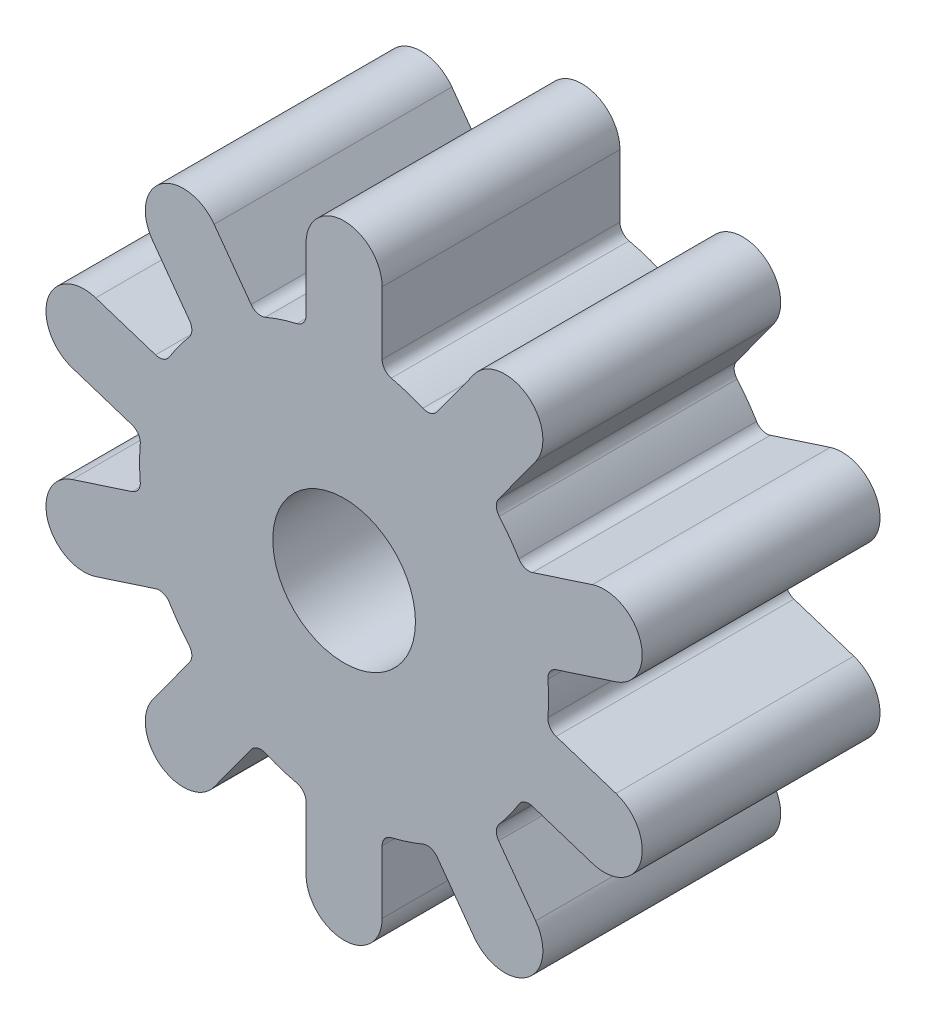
ISO-10303-21;
HEADER;
FILE_DESCRIPTION(('STEP AP214'),'2;1');
FILE_NAME('part.step','',(''),(''),'','','');
FILE_SCHEMA(('AUTOMOTIVE_DESIGN { 1 0 10303 214 1 1 1 1 }'));
ENDSEC;
DATA;
#1=APPLICATION_CONTEXT('core data for automotive mechanical design processes');
#2=APPLICATION_PROTOCOL_DEFINITION('international standard','automotive_design',2000,#1);
#3=PRODUCT_CONTEXT('',#1,'mechanical');
#4=PRODUCT('Part','Part','',(#3));
#5=PRODUCT_RELATED_PRODUCT_CATEGORY('part','',(#4));
#6=PRODUCT_DEFINITION_FORMATION('','',#4);
#7=PRODUCT_DEFINITION_CONTEXT('part definition',#1,'design');
#8=PRODUCT_DEFINITION('design','',#6,#7);
#9=PRODUCT_DEFINITION_SHAPE('','',#8);
#10=(LENGTH_UNIT() NAMED_UNIT(*) SI_UNIT(.MILLI.,.METRE.));
#11=(NAMED_UNIT(*) PLANE_ANGLE_UNIT() SI_UNIT($,.RADIAN.));
#12=(NAMED_UNIT(*) SI_UNIT($,.STERADIAN.) SOLID_ANGLE_UNIT());
#13=UNCERTAINTY_MEASURE_WITH_UNIT(LENGTH_MEASURE(1.E-05),#10,'distance_accuracy_value','');
#14=(GEOMETRIC_REPRESENTATION_CONTEXT(3) GLOBAL_UNCERTAINTY_ASSIGNED_CONTEXT((#13)) GLOBAL_UNIT_ASSIGNED_CONTEXT((#10,
#11,#12)) REPRESENTATION_CONTEXT('',''));
#15=CARTESIAN_POINT('',(0.,0.,0.));
#16=DIRECTION('',(0.,0.,1.));
#17=DIRECTION('',(1.,0.,0.));
#18=AXIS2_PLACEMENT_3D('',#15,#16,#17);
#19=CARTESIAN_POINT('',(2.1,8.85437744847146,10.));
#20=DIRECTION('',(0.,0.,-1.));
#21=DIRECTION('',(-1.,0.,0.));
#22=AXIS2_PLACEMENT_3D('',#19,#20,#21);
#23=CYLINDRICAL_SURFACE('',#22,0.5);
#24=CARTESIAN_POINT('',(2.1,8.85437744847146,0.));
#25=DIRECTION('',(0.,0.,-1.));
#26=DIRECTION('',(1.,0.,0.));
#27=AXIS2_PLACEMENT_3D('',#24,#25,#26);
#28=CIRCLE('',#27,0.5);
#29=CARTESIAN_POINT('',(1.98461538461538,8.36787319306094,0.));
#30=VERTEX_POINT('',#29);
#31=CARTESIAN_POINT('',(1.6,8.85437744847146,0.));
#32=VERTEX_POINT('',#31);
#33=EDGE_CURVE('E441',#30,#32,#28,.T.);
#34=ORIENTED_EDGE('',*,*,#33,.T.);
#35=DIRECTION('',(0.,0.,-1.));
#36=VECTOR('',#35,1.);
#37=CARTESIAN_POINT('',(1.6,8.85437744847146,10.));
#38=LINE('',#37,#36);
#39=CARTESIAN_POINT('',(1.6,8.85437744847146,10.));
#40=VERTEX_POINT('',#39);
#41=EDGE_CURVE('E11',#40,#32,#38,.T.);
#42=ORIENTED_EDGE('',*,*,#41,.F.);
#43=CARTESIAN_POINT('',(2.1,8.85437744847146,10.));
#44=DIRECTION('',(0.,0.,-1.));
#45=DIRECTION('',(1.,0.,0.));
#46=AXIS2_PLACEMENT_3D('',#43,#44,#45);
#47=CIRCLE('',#46,0.5);
#48=CARTESIAN_POINT('',(1.98461538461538,8.36787319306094,10.));
#49=VERTEX_POINT('',#48);
#50=EDGE_CURVE('E560',#49,#40,#47,.T.);
#51=ORIENTED_EDGE('',*,*,#50,.F.);
#52=DIRECTION('',(0.,0.,-1.));
#53=VECTOR('',#52,1.);
#54=CARTESIAN_POINT('',(1.98461538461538,8.36787319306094,10.));
#55=LINE('',#54,#53);
#56=EDGE_CURVE('E437',#49,#30,#55,.T.);
#57=ORIENTED_EDGE('',*,*,#56,.T.);
#58=EDGE_LOOP('',(#34,#42,#51,#57));
#59=FACE_BOUND('',#58,.T.);
#60=ADVANCED_FACE('F33',(#59),#23,.F.);
#61=CARTESIAN_POINT('',(1.6,11.5,10.));
#62=DIRECTION('',(-1.,0.,0.));
#63=DIRECTION('',(0.,0.,1.));
#64=AXIS2_PLACEMENT_3D('',#61,#62,#63);
#65=PLANE('',#64);
#66=DIRECTION('',(0.,1.,0.));
#67=VECTOR('',#66,1.);
#68=CARTESIAN_POINT('',(1.6,11.5,0.));
#69=LINE('',#68,#67);
#70=CARTESIAN_POINT('',(1.6,11.5,0.));
#71=VERTEX_POINT('',#70);
#72=EDGE_CURVE('E444',#32,#71,#69,.T.);
#73=ORIENTED_EDGE('',*,*,#72,.T.);
#74=DIRECTION('',(0.,0.,-1.));
#75=VECTOR('',#74,1.);
#76=CARTESIAN_POINT('',(1.6,11.5,10.));
#77=LINE('',#76,#75);
#78=CARTESIAN_POINT('',(1.6,11.5,10.));
#79=VERTEX_POINT('',#78);
#80=EDGE_CURVE('E41',#79,#71,#77,.T.);
#81=ORIENTED_EDGE('',*,*,#80,.F.);
#82=DIRECTION('',(0.,1.,0.));
#83=VECTOR('',#82,1.);
#84=CARTESIAN_POINT('',(1.6,11.5,10.));
#85=LINE('',#84,#83);
#86=EDGE_CURVE('E248',#40,#79,#85,.T.);
#87=ORIENTED_EDGE('',*,*,#86,.F.);
#88=ORIENTED_EDGE('',*,*,#41,.T.);
#89=EDGE_LOOP('',(#73,#81,#87,#88));
#90=FACE_BOUND('',#89,.T.);
#91=ADVANCED_FACE('F880',(#90),#65,.F.);
#92=CARTESIAN_POINT('',(0.,11.5,10.));
#93=DIRECTION('',(0.,0.,-1.));
#94=DIRECTION('',(-1.,0.,0.));
#95=AXIS2_PLACEMENT_3D('',#92,#93,#94);
#96=CYLINDRICAL_SURFACE('',#95,1.6);
#97=CARTESIAN_POINT('',(0.,11.5,0.));
#98=DIRECTION('',(0.,0.,1.));
#99=DIRECTION('',(1.,0.,0.));
#100=AXIS2_PLACEMENT_3D('',#97,#98,#99);
#101=CIRCLE('',#100,1.6);
#102=CARTESIAN_POINT('',(-1.6,11.5,0.));
#103=VERTEX_POINT('',#102);
#104=EDGE_CURVE('E447',#71,#103,#101,.T.);
#105=ORIENTED_EDGE('',*,*,#104,.T.);
#106=DIRECTION('',(0.,0.,-1.));
#107=VECTOR('',#106,1.);
#108=CARTESIAN_POINT('',(-1.6,11.5,10.));
#109=LINE('',#108,#107);
#110=CARTESIAN_POINT('',(-1.6,11.5,10.));
#111=VERTEX_POINT('',#110);
#112=EDGE_CURVE('E723',#111,#103,#109,.T.);
#113=ORIENTED_EDGE('',*,*,#112,.F.);
#114=CARTESIAN_POINT('',(0.,11.5,10.));
#115=DIRECTION('',(0.,0.,1.));
#116=DIRECTION('',(1.,0.,0.));
#117=AXIS2_PLACEMENT_3D('',#114,#115,#116);
#118=CIRCLE('',#117,1.6);
#119=EDGE_CURVE('E731',#79,#111,#118,.T.);
#120=ORIENTED_EDGE('',*,*,#119,.F.);
#121=ORIENTED_EDGE('',*,*,#80,.T.);
#122=EDGE_LOOP('',(#105,#113,#120,#121));
#123=FACE_BOUND('',#122,.T.);
#124=ADVANCED_FACE('F729',(#123),#96,.T.);
#125=CARTESIAN_POINT('',(-1.6,11.5,10.));
#126=DIRECTION('',(1.,0.,0.));
#127=DIRECTION('',(0.,0.,-1.));
#128=AXIS2_PLACEMENT_3D('',#125,#126,#127);
#129=PLANE('',#128);
#130=DIRECTION('',(0.,-1.,0.));
#131=VECTOR('',#130,1.);
#132=CARTESIAN_POINT('',(-1.6,11.5,0.));
#133=LINE('',#132,#131);
#134=CARTESIAN_POINT('',(-1.6,8.85437744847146,0.));
#135=VERTEX_POINT('',#134);
#136=EDGE_CURVE('E449',#103,#135,#133,.T.);
#137=ORIENTED_EDGE('',*,*,#136,.T.);
#138=DIRECTION('',(0.,0.,-1.));
#139=VECTOR('',#138,1.);
#140=CARTESIAN_POINT('',(-1.6,8.85437744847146,10.));
#141=LINE('',#140,#139);
#142=CARTESIAN_POINT('',(-1.6,8.85437744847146,10.));
#143=VERTEX_POINT('',#142);
#144=EDGE_CURVE('E720',#143,#135,#141,.T.);
#145=ORIENTED_EDGE('',*,*,#144,.F.);
#146=DIRECTION('',(0.,-1.,0.));
#147=VECTOR('',#146,1.);
#148=CARTESIAN_POINT('',(-1.6,11.5,10.));
#149=LINE('',#148,#147);
#150=EDGE_CURVE('E749',#111,#143,#149,.T.);
#151=ORIENTED_EDGE('',*,*,#150,.F.);
#152=ORIENTED_EDGE('',*,*,#112,.T.);
#153=EDGE_LOOP('',(#137,#145,#151,#152));
#154=FACE_BOUND('',#153,.T.);
#155=ADVANCED_FACE('F740',(#154),#129,.F.);
#156=CARTESIAN_POINT('',(-2.1,8.85437744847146,10.));
#157=DIRECTION('',(0.,0.,-1.));
#158=DIRECTION('',(-1.,0.,0.));
#159=AXIS2_PLACEMENT_3D('',#156,#157,#158);
#160=CYLINDRICAL_SURFACE('',#159,0.5);
#161=CARTESIAN_POINT('',(-2.1,8.85437744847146,0.));
#162=DIRECTION('',(0.,0.,-1.));
#163=DIRECTION('',(-1.,0.,0.));
#164=AXIS2_PLACEMENT_3D('',#161,#162,#163);
#165=CIRCLE('',#164,0.5);
#166=CARTESIAN_POINT('',(-1.98461538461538,8.36787319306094,0.));
#167=VERTEX_POINT('',#166);
#168=EDGE_CURVE('E451',#135,#167,#165,.T.);
#169=ORIENTED_EDGE('',*,*,#168,.T.);
#170=DIRECTION('',(0.,0.,-1.));
#171=VECTOR('',#170,1.);
#172=CARTESIAN_POINT('',(-1.98461538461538,8.36787319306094,10.));
#173=LINE('',#172,#171);
#174=CARTESIAN_POINT('',(-1.98461538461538,8.36787319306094,10.));
#175=VERTEX_POINT('',#174);
#176=EDGE_CURVE('E717',#175,#167,#173,.T.);
#177=ORIENTED_EDGE('',*,*,#176,.F.);
#178=CARTESIAN_POINT('',(-2.1,8.85437744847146,10.));
#179=DIRECTION('',(0.,0.,-1.));
#180=DIRECTION('',(-1.,0.,0.));
#181=AXIS2_PLACEMENT_3D('',#178,#179,#180);
#182=CIRCLE('',#181,0.5);
#183=EDGE_CURVE('E746',#143,#175,#182,.T.);
#184=ORIENTED_EDGE('',*,*,#183,.F.);
#185=ORIENTED_EDGE('',*,*,#144,.T.);
#186=EDGE_LOOP('',(#169,#177,#184,#185));
#187=FACE_BOUND('',#186,.T.);
#188=ADVANCED_FACE('F744',(#187),#160,.F.);
#189=CARTESIAN_POINT('',(0.,0.,10.));
#190=DIRECTION('',(0.,0.,-1.));
#191=DIRECTION('',(-1.,0.,0.));
#192=AXIS2_PLACEMENT_3D('',#189,#190,#191);
#193=CYLINDRICAL_SURFACE('',#192,8.6);
#194=CARTESIAN_POINT('',(0.,0.,0.));
#195=DIRECTION('',(0.,0.,1.));
#196=DIRECTION('',(1.,0.,0.));
#197=AXIS2_PLACEMENT_3D('',#194,#195,#196);
#198=CIRCLE('',#197,8.6);
#199=CARTESIAN_POINT('',(-3.31292488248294,7.93627927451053,0.));
#200=VERTEX_POINT('',#199);
#201=EDGE_CURVE('E453',#167,#200,#198,.T.);
#202=ORIENTED_EDGE('',*,*,#201,.T.);
#203=DIRECTION('',(0.,0.,-1.));
#204=VECTOR('',#203,1.);
#205=CARTESIAN_POINT('',(-3.31292488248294,7.93627927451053,10.));
#206=LINE('',#205,#204);
#207=CARTESIAN_POINT('',(-3.31292488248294,7.93627927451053,10.));
#208=VERTEX_POINT('',#207);
#209=EDGE_CURVE('E714',#208,#200,#206,.T.);
#210=ORIENTED_EDGE('',*,*,#209,.F.);
#211=CARTESIAN_POINT('',(0.,0.,10.));
#212=DIRECTION('',(0.,0.,1.));
#213=DIRECTION('',(1.,0.,0.));
#214=AXIS2_PLACEMENT_3D('',#211,#212,#213);
#215=CIRCLE('',#214,8.6);
#216=EDGE_CURVE('E748',#175,#208,#215,.T.);
#217=ORIENTED_EDGE('',*,*,#216,.F.);
#218=ORIENTED_EDGE('',*,*,#176,.T.);
#219=EDGE_LOOP('',(#202,#210,#217,#218));
#220=FACE_BOUND('',#219,.T.);
#221=ADVANCED_FACE('F893',(#220),#193,.T.);
#222=CARTESIAN_POINT('',(-3.50553679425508,8.39769086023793,10.));
#223=DIRECTION('',(0.,0.,-1.));
#224=DIRECTION('',(-1.,0.,0.));
#225=AXIS2_PLACEMENT_3D('',#222,#223,#224);
#226=CYLINDRICAL_SURFACE('',#225,0.499999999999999);
#227=CARTESIAN_POINT('',(-3.50553679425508,8.39769086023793,0.));
#228=DIRECTION('',(0.,0.,-1.));
#229=DIRECTION('',(1.,0.,0.));
#230=AXIS2_PLACEMENT_3D('',#227,#228,#229);
#231=CIRCLE('',#230,0.499999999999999);
#232=CARTESIAN_POINT('',(-3.91004529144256,8.10379823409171,0.));
#233=VERTEX_POINT('',#232);
#234=EDGE_CURVE('E455',#200,#233,#231,.T.);
#235=ORIENTED_EDGE('',*,*,#234,.T.);
#236=DIRECTION('',(0.,0.,-1.));
#237=VECTOR('',#236,1.);
#238=CARTESIAN_POINT('',(-3.91004529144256,8.10379823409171,10.));
#239=LINE('',#238,#237);
#240=CARTESIAN_POINT('',(-3.91004529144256,8.10379823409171,10.));
#241=VERTEX_POINT('',#240);
#242=EDGE_CURVE('E711',#241,#233,#239,.T.);
#243=ORIENTED_EDGE('',*,*,#242,.F.);
#244=CARTESIAN_POINT('',(-3.50553679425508,8.39769086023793,10.));
#245=DIRECTION('',(0.,0.,-1.));
#246=DIRECTION('',(1.,0.,0.));
#247=AXIS2_PLACEMENT_3D('',#244,#245,#246);
#248=CIRCLE('',#247,0.499999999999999);
#249=EDGE_CURVE('E751',#208,#241,#248,.T.);
#250=ORIENTED_EDGE('',*,*,#249,.F.);
#251=ORIENTED_EDGE('',*,*,#209,.T.);
#252=EDGE_LOOP('',(#235,#243,#250,#251));
#253=FACE_BOUND('',#252,.T.);
#254=ADVANCED_FACE('F896',(#253),#226,.F.);
#255=CARTESIAN_POINT('',(-5.46510321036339,10.2441518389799,10.));
#256=DIRECTION('',(-0.809016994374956,-0.587785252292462,0.));
#257=DIRECTION('',(0.587785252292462,-0.809016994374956,0.));
#258=AXIS2_PLACEMENT_3D('',#255,#256,#257);
#259=PLANE('',#258);
#260=DIRECTION('',(-0.587785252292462,0.809016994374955,0.));
#261=VECTOR('',#260,1.);
#262=CARTESIAN_POINT('',(-5.46510321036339,10.2441518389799,0.));
#263=LINE('',#262,#261);
#264=CARTESIAN_POINT('',(-5.46510321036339,10.2441518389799,0.));
#265=VERTEX_POINT('',#264);
#266=EDGE_CURVE('E457',#233,#265,#263,.T.);
#267=ORIENTED_EDGE('',*,*,#266,.T.);
#268=DIRECTION('',(0.,0.,-1.));
#269=VECTOR('',#268,1.);
#270=CARTESIAN_POINT('',(-5.46510321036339,10.2441518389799,10.));
#271=LINE('',#270,#269);
#272=CARTESIAN_POINT('',(-5.46510321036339,10.2441518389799,10.));
#273=VERTEX_POINT('',#272);
#274=EDGE_CURVE('E708',#273,#265,#271,.T.);
#275=ORIENTED_EDGE('',*,*,#274,.F.);
#276=DIRECTION('',(-0.587785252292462,0.809016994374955,0.));
#277=VECTOR('',#276,1.);
#278=CARTESIAN_POINT('',(-5.46510321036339,10.2441518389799,10.));
#279=LINE('',#278,#277);
#280=EDGE_CURVE('E757',#241,#273,#279,.T.);
#281=ORIENTED_EDGE('',*,*,#280,.F.);
#282=ORIENTED_EDGE('',*,*,#242,.T.);
#283=EDGE_LOOP('',(#267,#275,#281,#282));
#284=FACE_BOUND('',#283,.T.);
#285=ADVANCED_FACE('F900',(#284),#259,.F.);
#286=CARTESIAN_POINT('',(-6.75953040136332,9.30369543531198,10.));
#287=DIRECTION('',(0.,0.,-1.));
#288=DIRECTION('',(-1.,0.,0.));
#289=AXIS2_PLACEMENT_3D('',#286,#287,#288);
#290=CYLINDRICAL_SURFACE('',#289,1.6);
#291=CARTESIAN_POINT('',(-6.75953040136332,9.30369543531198,0.));
#292=DIRECTION('',(0.,0.,1.));
#293=DIRECTION('',(1.,0.,0.));
#294=AXIS2_PLACEMENT_3D('',#291,#292,#293);
#295=CIRCLE('',#294,1.6);
#296=CARTESIAN_POINT('',(-8.05395759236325,8.36323903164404,0.));
#297=VERTEX_POINT('',#296);
#298=EDGE_CURVE('E459',#265,#297,#295,.T.);
#299=ORIENTED_EDGE('',*,*,#298,.T.);
#300=DIRECTION('',(0.,0.,-1.));
#301=VECTOR('',#300,1.);
#302=CARTESIAN_POINT('',(-8.05395759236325,8.36323903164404,10.));
#303=LINE('',#302,#301);
#304=CARTESIAN_POINT('',(-8.05395759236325,8.36323903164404,10.));
#305=VERTEX_POINT('',#304);
#306=EDGE_CURVE('E705',#305,#297,#303,.T.);
#307=ORIENTED_EDGE('',*,*,#306,.F.);
#308=CARTESIAN_POINT('',(-6.75953040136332,9.30369543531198,10.));
#309=DIRECTION('',(0.,0.,1.));
#310=DIRECTION('',(1.,0.,0.));
#311=AXIS2_PLACEMENT_3D('',#308,#309,#310);
#312=CIRCLE('',#311,1.6);
#313=EDGE_CURVE('E759',#273,#305,#312,.T.);
#314=ORIENTED_EDGE('',*,*,#313,.F.);
#315=ORIENTED_EDGE('',*,*,#274,.T.);
#316=EDGE_LOOP('',(#299,#307,#314,#315));
#317=FACE_BOUND('',#316,.T.);
#318=ADVANCED_FACE('F904',(#317),#290,.T.);
#319=CARTESIAN_POINT('',(-8.05395759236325,8.36323903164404,10.));
#320=DIRECTION('',(0.809016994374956,0.587785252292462,0.));
#321=DIRECTION('',(-0.587785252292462,0.809016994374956,0.));
#322=AXIS2_PLACEMENT_3D('',#319,#320,#321);
#323=PLANE('',#322);
#324=DIRECTION('',(0.587785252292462,-0.809016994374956,0.));
#325=VECTOR('',#324,1.);
#326=CARTESIAN_POINT('',(-8.05395759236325,8.36323903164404,0.));
#327=LINE('',#326,#325);
#328=CARTESIAN_POINT('',(-6.49889967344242,6.22288542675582,0.));
#329=VERTEX_POINT('',#328);
#330=EDGE_CURVE('E461',#297,#329,#327,.T.);
#331=ORIENTED_EDGE('',*,*,#330,.T.);
#332=DIRECTION('',(0.,0.,-1.));
#333=VECTOR('',#332,1.);
#334=CARTESIAN_POINT('',(-6.49889967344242,6.22288542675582,10.));
#335=LINE('',#334,#333);
#336=CARTESIAN_POINT('',(-6.49889967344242,6.22288542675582,10.));
#337=VERTEX_POINT('',#336);
#338=EDGE_CURVE('E702',#337,#329,#335,.T.);
#339=ORIENTED_EDGE('',*,*,#338,.F.);
#340=DIRECTION('',(0.587785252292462,-0.809016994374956,0.));
#341=VECTOR('',#340,1.);
#342=CARTESIAN_POINT('',(-8.05395759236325,8.36323903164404,10.));
#343=LINE('',#342,#341);
#344=EDGE_CURVE('E761',#305,#337,#343,.T.);
#345=ORIENTED_EDGE('',*,*,#344,.F.);
#346=ORIENTED_EDGE('',*,*,#306,.T.);
#347=EDGE_LOOP('',(#331,#339,#345,#346));
#348=FACE_BOUND('',#347,.T.);
#349=ADVANCED_FACE('F908',(#348),#323,.F.);
#350=CARTESIAN_POINT('',(-6.90340817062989,5.92899280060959,10.));
#351=DIRECTION('',(0.,0.,-1.));
#352=DIRECTION('',(-1.,0.,0.));
#353=AXIS2_PLACEMENT_3D('',#350,#351,#352);
#354=CYLINDRICAL_SURFACE('',#353,0.499999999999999);
#355=CARTESIAN_POINT('',(-6.90340817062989,5.92899280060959,0.));
#356=DIRECTION('',(0.,0.,-1.));
#357=DIRECTION('',(-1.,0.,0.));
#358=AXIS2_PLACEMENT_3D('',#355,#356,#357);
#359=CIRCLE('',#358,0.499999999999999);
#360=CARTESIAN_POINT('',(-6.52410002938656,5.60322396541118,0.));
#361=VERTEX_POINT('',#360);
#362=EDGE_CURVE('E463',#329,#361,#359,.T.);
#363=ORIENTED_EDGE('',*,*,#362,.T.);
#364=DIRECTION('',(0.,0.,-1.));
#365=VECTOR('',#364,1.);
#366=CARTESIAN_POINT('',(-6.52410002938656,5.60322396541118,10.));
#367=LINE('',#366,#365);
#368=CARTESIAN_POINT('',(-6.52410002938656,5.60322396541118,10.));
#369=VERTEX_POINT('',#368);
#370=EDGE_CURVE('E699',#369,#361,#367,.T.);
#371=ORIENTED_EDGE('',*,*,#370,.F.);
#372=CARTESIAN_POINT('',(-6.90340817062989,5.92899280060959,10.));
#373=DIRECTION('',(0.,0.,-1.));
#374=DIRECTION('',(-1.,0.,0.));
#375=AXIS2_PLACEMENT_3D('',#372,#373,#374);
#376=CIRCLE('',#375,0.499999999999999);
#377=EDGE_CURVE('E763',#337,#369,#376,.T.);
#378=ORIENTED_EDGE('',*,*,#377,.F.);
#379=ORIENTED_EDGE('',*,*,#338,.T.);
#380=EDGE_LOOP('',(#363,#371,#378,#379));
#381=FACE_BOUND('',#380,.T.);
#382=ADVANCED_FACE('F912',(#381),#354,.F.);
#383=CARTESIAN_POINT('',(0.,0.,10.));
#384=DIRECTION('',(0.,0.,-1.));
#385=DIRECTION('',(-1.,0.,0.));
#386=AXIS2_PLACEMENT_3D('',#383,#384,#385);
#387=CYLINDRICAL_SURFACE('',#386,8.6);
#388=CARTESIAN_POINT('',(0.,0.,0.));
#389=DIRECTION('',(0.,0.,1.));
#390=DIRECTION('',(1.,0.,0.));
#391=AXIS2_PLACEMENT_3D('',#388,#389,#390);
#392=CIRCLE('',#391,8.6);
#393=CARTESIAN_POINT('',(-7.34504044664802,4.47329641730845,0.));
#394=VERTEX_POINT('',#393);
#395=EDGE_CURVE('E465',#361,#394,#392,.T.);
#396=ORIENTED_EDGE('',*,*,#395,.T.);
#397=DIRECTION('',(0.,0.,-1.));
#398=VECTOR('',#397,1.);
#399=CARTESIAN_POINT('',(-7.34504044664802,4.47329641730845,10.));
#400=LINE('',#399,#398);
#401=CARTESIAN_POINT('',(-7.34504044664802,4.47329641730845,10.));
#402=VERTEX_POINT('',#401);
#403=EDGE_CURVE('E696',#402,#394,#400,.T.);
#404=ORIENTED_EDGE('',*,*,#403,.F.);
#405=CARTESIAN_POINT('',(0.,0.,10.));
#406=DIRECTION('',(0.,0.,1.));
#407=DIRECTION('',(1.,0.,0.));
#408=AXIS2_PLACEMENT_3D('',#405,#406,#407);
#409=CIRCLE('',#408,8.6);
#410=EDGE_CURVE('E765',#369,#402,#409,.T.);
#411=ORIENTED_EDGE('',*,*,#410,.F.);
#412=ORIENTED_EDGE('',*,*,#370,.T.);
#413=EDGE_LOOP('',(#396,#404,#411,#412));
#414=FACE_BOUND('',#413,.T.);
#415=ADVANCED_FACE('F916',(#414),#387,.T.);
#416=CARTESIAN_POINT('',(-7.7720776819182,4.73337179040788,10.));
#417=DIRECTION('',(0.,0.,-1.));
#418=DIRECTION('',(-1.,0.,0.));
#419=AXIS2_PLACEMENT_3D('',#416,#417,#418);
#420=CYLINDRICAL_SURFACE('',#419,0.5);
#421=CARTESIAN_POINT('',(-7.7720776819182,4.73337179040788,0.));
#422=DIRECTION('',(0.,0.,-1.));
#423=DIRECTION('',(1.,0.,0.));
#424=AXIS2_PLACEMENT_3D('',#421,#422,#423);
#425=CIRCLE('',#424,0.5);
#426=CARTESIAN_POINT('',(-7.92658617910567,4.2578435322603,0.));
#427=VERTEX_POINT('',#426);
#428=EDGE_CURVE('E467',#394,#427,#425,.T.);
#429=ORIENTED_EDGE('',*,*,#428,.T.);
#430=DIRECTION('',(0.,0.,-1.));
#431=VECTOR('',#430,1.);
#432=CARTESIAN_POINT('',(-7.92658617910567,4.2578435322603,10.));
#433=LINE('',#432,#431);
#434=CARTESIAN_POINT('',(-7.92658617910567,4.2578435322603,10.));
#435=VERTEX_POINT('',#434);
#436=EDGE_CURVE('E693',#435,#427,#433,.T.);
#437=ORIENTED_EDGE('',*,*,#436,.F.);
#438=CARTESIAN_POINT('',(-7.7720776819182,4.73337179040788,10.));
#439=DIRECTION('',(0.,0.,-1.));
#440=DIRECTION('',(1.,0.,0.));
#441=AXIS2_PLACEMENT_3D('',#438,#439,#440);
#442=CIRCLE('',#441,0.5);
#443=EDGE_CURVE('E767',#402,#435,#442,.T.);
#444=ORIENTED_EDGE('',*,*,#443,.F.);
#445=ORIENTED_EDGE('',*,*,#403,.T.);
#446=EDGE_LOOP('',(#429,#437,#444,#445));
#447=FACE_BOUND('',#446,.T.);
#448=ADVANCED_FACE('F920',(#447),#420,.F.);
#449=CARTESIAN_POINT('',(-10.4427227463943,5.07538586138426,10.));
#450=DIRECTION('',(-0.309016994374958,-0.95105651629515,0.));
#451=DIRECTION('',(0.95105651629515,-0.309016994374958,0.));
#452=AXIS2_PLACEMENT_3D('',#449,#450,#451);
#453=PLANE('',#452);
#454=DIRECTION('',(-0.95105651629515,0.309016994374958,0.));
#455=VECTOR('',#454,1.);
#456=CARTESIAN_POINT('',(-10.4427227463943,5.07538586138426,0.));
#457=LINE('',#456,#455);
#458=CARTESIAN_POINT('',(-10.4427227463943,5.07538586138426,0.));
#459=VERTEX_POINT('',#458);
#460=EDGE_CURVE('E469',#427,#459,#457,.T.);
#461=ORIENTED_EDGE('',*,*,#460,.T.);
#462=DIRECTION('',(0.,0.,-1.));
#463=VECTOR('',#462,1.);
#464=CARTESIAN_POINT('',(-10.4427227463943,5.07538586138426,10.));
#465=LINE('',#464,#463);
#466=CARTESIAN_POINT('',(-10.4427227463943,5.07538586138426,10.));
#467=VERTEX_POINT('',#466);
#468=EDGE_CURVE('E690',#467,#459,#465,.T.);
#469=ORIENTED_EDGE('',*,*,#468,.F.);
#470=DIRECTION('',(-0.95105651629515,0.309016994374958,0.));
#471=VECTOR('',#470,1.);
#472=CARTESIAN_POINT('',(-10.4427227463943,5.07538586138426,10.));
#473=LINE('',#472,#471);
#474=EDGE_CURVE('E769',#435,#467,#473,.T.);
#475=ORIENTED_EDGE('',*,*,#474,.F.);
#476=ORIENTED_EDGE('',*,*,#436,.T.);
#477=EDGE_LOOP('',(#461,#469,#475,#476));
#478=FACE_BOUND('',#477,.T.);
#479=ADVANCED_FACE('F924',(#478),#453,.F.);
#480=CARTESIAN_POINT('',(-10.9371499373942,3.55369543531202,10.));
#481=DIRECTION('',(0.,0.,-1.));
#482=DIRECTION('',(-1.,0.,0.));
#483=AXIS2_PLACEMENT_3D('',#480,#481,#482);
#484=CYLINDRICAL_SURFACE('',#483,1.6);
#485=CARTESIAN_POINT('',(-10.9371499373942,3.55369543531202,0.));
#486=DIRECTION('',(0.,0.,1.));
#487=DIRECTION('',(1.,0.,0.));
#488=AXIS2_PLACEMENT_3D('',#485,#486,#487);
#489=CIRCLE('',#488,1.6);
#490=CARTESIAN_POINT('',(-11.4315771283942,2.03200500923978,0.));
#491=VERTEX_POINT('',#490);
#492=EDGE_CURVE('E471',#459,#491,#489,.T.);
#493=ORIENTED_EDGE('',*,*,#492,.T.);
#494=DIRECTION('',(0.,0.,-1.));
#495=VECTOR('',#494,1.);
#496=CARTESIAN_POINT('',(-11.4315771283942,2.03200500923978,10.));
#497=LINE('',#496,#495);
#498=CARTESIAN_POINT('',(-11.4315771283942,2.03200500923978,10.));
#499=VERTEX_POINT('',#498);
#500=EDGE_CURVE('E687',#499,#491,#497,.T.);
#501=ORIENTED_EDGE('',*,*,#500,.F.);
#502=CARTESIAN_POINT('',(-10.9371499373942,3.55369543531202,10.));
#503=DIRECTION('',(0.,0.,1.));
#504=DIRECTION('',(1.,0.,0.));
#505=AXIS2_PLACEMENT_3D('',#502,#503,#504);
#506=CIRCLE('',#505,1.6);
#507=EDGE_CURVE('E771',#467,#499,#506,.T.);
#508=ORIENTED_EDGE('',*,*,#507,.F.);
#509=ORIENTED_EDGE('',*,*,#468,.T.);
#510=EDGE_LOOP('',(#493,#501,#508,#509));
#511=FACE_BOUND('',#510,.T.);
#512=ADVANCED_FACE('F928',(#511),#484,.T.);
#513=CARTESIAN_POINT('',(-11.4315771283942,2.03200500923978,10.));
#514=DIRECTION('',(0.309016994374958,0.95105651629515,0.));
#515=DIRECTION('',(-0.95105651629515,0.309016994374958,0.));
#516=AXIS2_PLACEMENT_3D('',#513,#514,#515);
#517=PLANE('',#516);
#518=DIRECTION('',(0.95105651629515,-0.309016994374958,0.));
#519=VECTOR('',#518,1.);
#520=CARTESIAN_POINT('',(-11.4315771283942,2.03200500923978,0.));
#521=LINE('',#520,#519);
#522=CARTESIAN_POINT('',(-8.91544056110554,1.21446268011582,0.));
#523=VERTEX_POINT('',#522);
#524=EDGE_CURVE('E473',#491,#523,#521,.T.);
#525=ORIENTED_EDGE('',*,*,#524,.T.);
#526=DIRECTION('',(0.,0.,-1.));
#527=VECTOR('',#526,1.);
#528=CARTESIAN_POINT('',(-8.91544056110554,1.21446268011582,10.));
#529=LINE('',#528,#527);
#530=CARTESIAN_POINT('',(-8.91544056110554,1.21446268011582,10.));
#531=VERTEX_POINT('',#530);
#532=EDGE_CURVE('E684',#531,#523,#529,.T.);
#533=ORIENTED_EDGE('',*,*,#532,.F.);
#534=DIRECTION('',(0.95105651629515,-0.309016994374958,0.));
#535=VECTOR('',#534,1.);
#536=CARTESIAN_POINT('',(-11.4315771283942,2.03200500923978,10.));
#537=LINE('',#536,#535);
#538=EDGE_CURVE('E773',#499,#531,#537,.T.);
#539=ORIENTED_EDGE('',*,*,#538,.F.);
#540=ORIENTED_EDGE('',*,*,#500,.T.);
#541=EDGE_LOOP('',(#525,#533,#539,#540));
#542=FACE_BOUND('',#541,.T.);
#543=ADVANCED_FACE('F932',(#542),#517,.F.);
#544=CARTESIAN_POINT('',(-9.06994905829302,0.738934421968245,10.));
#545=DIRECTION('',(0.,0.,-1.));
#546=DIRECTION('',(-1.,0.,0.));
#547=AXIS2_PLACEMENT_3D('',#544,#545,#546);
#548=CYLINDRICAL_SURFACE('',#547,0.5);
#549=CARTESIAN_POINT('',(-9.06994905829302,0.738934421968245,0.));
#550=DIRECTION('',(0.,0.,-1.));
#551=DIRECTION('',(-1.,0.,0.));
#552=AXIS2_PLACEMENT_3D('',#549,#550,#551);
#553=CIRCLE('',#552,0.5);
#554=CARTESIAN_POINT('',(-8.57160020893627,0.698333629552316,0.));
#555=VERTEX_POINT('',#554);
#556=EDGE_CURVE('E475',#523,#555,#553,.T.);
#557=ORIENTED_EDGE('',*,*,#556,.T.);
#558=DIRECTION('',(0.,0.,-1.));
#559=VECTOR('',#558,1.);
#560=CARTESIAN_POINT('',(-8.57160020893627,0.698333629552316,10.));
#561=LINE('',#560,#559);
#562=CARTESIAN_POINT('',(-8.57160020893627,0.698333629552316,10.));
#563=VERTEX_POINT('',#562);
#564=EDGE_CURVE('E681',#563,#555,#561,.T.);
#565=ORIENTED_EDGE('',*,*,#564,.F.);
#566=CARTESIAN_POINT('',(-9.06994905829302,0.738934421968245,10.));
#567=DIRECTION('',(0.,0.,-1.));
#568=DIRECTION('',(-1.,0.,0.));
#569=AXIS2_PLACEMENT_3D('',#566,#567,#568);
#570=CIRCLE('',#569,0.5);
#571=EDGE_CURVE('E775',#531,#563,#570,.T.);
#572=ORIENTED_EDGE('',*,*,#571,.F.);
#573=ORIENTED_EDGE('',*,*,#532,.T.);
#574=EDGE_LOOP('',(#557,#565,#572,#573));
#575=FACE_BOUND('',#574,.T.);
#576=ADVANCED_FACE('F936',(#575),#548,.F.);
#577=CARTESIAN_POINT('',(0.,0.,10.));
#578=DIRECTION('',(0.,0.,-1.));
#579=DIRECTION('',(-1.,0.,0.));
#580=AXIS2_PLACEMENT_3D('',#577,#578,#579);
#581=CYLINDRICAL_SURFACE('',#580,8.6);
#582=CARTESIAN_POINT('',(0.,0.,0.));
#583=DIRECTION('',(0.,0.,1.));
#584=DIRECTION('',(1.,0.,0.));
#585=AXIS2_PLACEMENT_3D('',#582,#583,#584);
#586=CIRCLE('',#585,8.6);
#587=CARTESIAN_POINT('',(-8.57160020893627,-0.698333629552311,0.));
#588=VERTEX_POINT('',#587);
#589=EDGE_CURVE('E477',#555,#588,#586,.T.);
#590=ORIENTED_EDGE('',*,*,#589,.T.);
#591=DIRECTION('',(0.,0.,-1.));
#592=VECTOR('',#591,1.);
#593=CARTESIAN_POINT('',(-8.57160020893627,-0.698333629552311,10.));
#594=LINE('',#593,#592);
#595=CARTESIAN_POINT('',(-8.57160020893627,-0.698333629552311,10.));
#596=VERTEX_POINT('',#595);
#597=EDGE_CURVE('E678',#596,#588,#594,.T.);
#598=ORIENTED_EDGE('',*,*,#597,.F.);
#599=CARTESIAN_POINT('',(0.,0.,10.));
#600=DIRECTION('',(0.,0.,1.));
#601=DIRECTION('',(1.,0.,0.));
#602=AXIS2_PLACEMENT_3D('',#599,#600,#601);
#603=CIRCLE('',#602,8.6);
#604=EDGE_CURVE('E777',#563,#596,#603,.T.);
#605=ORIENTED_EDGE('',*,*,#604,.F.);
#606=ORIENTED_EDGE('',*,*,#564,.T.);
#607=EDGE_LOOP('',(#590,#598,#605,#606));
#608=FACE_BOUND('',#607,.T.);
#609=ADVANCED_FACE('F940',(#608),#581,.T.);
#610=CARTESIAN_POINT('',(-9.06994905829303,-0.738934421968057,10.));
#611=DIRECTION('',(0.,0.,-1.));
#612=DIRECTION('',(-1.,0.,0.));
#613=AXIS2_PLACEMENT_3D('',#610,#611,#612);
#614=CYLINDRICAL_SURFACE('',#613,0.50000000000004);
#615=CARTESIAN_POINT('',(-9.06994905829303,-0.738934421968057,0.));
#616=DIRECTION('',(0.,0.,-1.));
#617=DIRECTION('',(1.,0.,0.));
#618=AXIS2_PLACEMENT_3D('',#615,#616,#617);
#619=CIRCLE('',#618,0.50000000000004);
#620=CARTESIAN_POINT('',(-8.91544056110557,-1.21446268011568,0.));
#621=VERTEX_POINT('',#620);
#622=EDGE_CURVE('E479',#588,#621,#619,.T.);
#623=ORIENTED_EDGE('',*,*,#622,.T.);
#624=DIRECTION('',(0.,0.,-1.));
#625=VECTOR('',#624,1.);
#626=CARTESIAN_POINT('',(-8.91544056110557,-1.21446268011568,10.));
#627=LINE('',#626,#625);
#628=CARTESIAN_POINT('',(-8.91544056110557,-1.21446268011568,10.));
#629=VERTEX_POINT('',#628);
#630=EDGE_CURVE('E675',#629,#621,#627,.T.);
#631=ORIENTED_EDGE('',*,*,#630,.F.);
#632=CARTESIAN_POINT('',(-9.06994905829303,-0.738934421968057,10.));
#633=DIRECTION('',(0.,0.,-1.));
#634=DIRECTION('',(1.,0.,0.));
#635=AXIS2_PLACEMENT_3D('',#632,#633,#634);
#636=CIRCLE('',#635,0.50000000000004);
#637=EDGE_CURVE('E779',#596,#629,#636,.T.);
#638=ORIENTED_EDGE('',*,*,#637,.F.);
#639=ORIENTED_EDGE('',*,*,#597,.T.);
#640=EDGE_LOOP('',(#623,#631,#638,#639));
#641=FACE_BOUND('',#640,.T.);
#642=ADVANCED_FACE('F944',(#641),#614,.F.);
#643=CARTESIAN_POINT('',(-11.4315771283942,-2.03200500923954,10.));
#644=DIRECTION('',(0.309016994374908,-0.951056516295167,0.));
#645=DIRECTION('',(0.951056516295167,0.309016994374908,0.));
#646=AXIS2_PLACEMENT_3D('',#643,#644,#645);
#647=PLANE('',#646);
#648=DIRECTION('',(-0.951056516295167,-0.309016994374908,0.));
#649=VECTOR('',#648,1.);
#650=CARTESIAN_POINT('',(-11.4315771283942,-2.03200500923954,0.));
#651=LINE('',#650,#649);
#652=CARTESIAN_POINT('',(-11.4315771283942,-2.03200500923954,0.));
#653=VERTEX_POINT('',#652);
#654=EDGE_CURVE('E481',#621,#653,#651,.T.);
#655=ORIENTED_EDGE('',*,*,#654,.T.);
#656=DIRECTION('',(0.,0.,-1.));
#657=VECTOR('',#656,1.);
#658=CARTESIAN_POINT('',(-11.4315771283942,-2.03200500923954,10.));
#659=LINE('',#658,#657);
#660=CARTESIAN_POINT('',(-11.4315771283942,-2.03200500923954,10.));
#661=VERTEX_POINT('',#660);
#662=EDGE_CURVE('E672',#661,#653,#659,.T.);
#663=ORIENTED_EDGE('',*,*,#662,.F.);
#664=DIRECTION('',(-0.951056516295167,-0.309016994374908,0.));
#665=VECTOR('',#664,1.);
#666=CARTESIAN_POINT('',(-11.4315771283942,-2.03200500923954,10.));
#667=LINE('',#666,#665);
#668=EDGE_CURVE('E781',#629,#661,#667,.T.);
#669=ORIENTED_EDGE('',*,*,#668,.F.);
#670=ORIENTED_EDGE('',*,*,#630,.T.);
#671=EDGE_LOOP('',(#655,#663,#669,#670));
#672=FACE_BOUND('',#671,.T.);
#673=ADVANCED_FACE('F948',(#672),#647,.F.);
#674=CARTESIAN_POINT('',(-10.9371499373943,-3.55369543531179,10.));
#675=DIRECTION('',(0.,0.,-1.));
#676=DIRECTION('',(-1.,0.,0.));
#677=AXIS2_PLACEMENT_3D('',#674,#675,#676);
#678=CYLINDRICAL_SURFACE('',#677,1.6);
#679=CARTESIAN_POINT('',(-10.9371499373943,-3.55369543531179,0.));
#680=DIRECTION('',(0.,0.,1.));
#681=DIRECTION('',(1.,0.,0.));
#682=AXIS2_PLACEMENT_3D('',#679,#680,#681);
#683=CIRCLE('',#682,1.6);
#684=CARTESIAN_POINT('',(-10.4427227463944,-5.07538586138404,0.));
#685=VERTEX_POINT('',#684);
#686=EDGE_CURVE('E483',#653,#685,#683,.T.);
#687=ORIENTED_EDGE('',*,*,#686,.T.);
#688=DIRECTION('',(0.,0.,-1.));
#689=VECTOR('',#688,1.);
#690=CARTESIAN_POINT('',(-10.4427227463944,-5.07538586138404,10.));
#691=LINE('',#690,#689);
#692=CARTESIAN_POINT('',(-10.4427227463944,-5.07538586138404,10.));
#693=VERTEX_POINT('',#692);
#694=EDGE_CURVE('E669',#693,#685,#691,.T.);
#695=ORIENTED_EDGE('',*,*,#694,.F.);
#696=CARTESIAN_POINT('',(-10.9371499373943,-3.55369543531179,10.));
#697=DIRECTION('',(0.,0.,1.));
#698=DIRECTION('',(1.,0.,0.));
#699=AXIS2_PLACEMENT_3D('',#696,#697,#698);
#700=CIRCLE('',#699,1.6);
#701=EDGE_CURVE('E783',#661,#693,#700,.T.);
#702=ORIENTED_EDGE('',*,*,#701,.F.);
#703=ORIENTED_EDGE('',*,*,#662,.T.);
#704=EDGE_LOOP('',(#687,#695,#702,#703));
#705=FACE_BOUND('',#704,.T.);
#706=ADVANCED_FACE('F952',(#705),#678,.T.);
#707=CARTESIAN_POINT('',(-10.4427227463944,-5.07538586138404,10.));
#708=DIRECTION('',(-0.309016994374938,0.951056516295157,0.));
#709=DIRECTION('',(-0.951056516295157,-0.309016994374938,0.));
#710=AXIS2_PLACEMENT_3D('',#707,#708,#709);
#711=PLANE('',#710);
#712=DIRECTION('',(0.951056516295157,0.309016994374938,0.));
#713=VECTOR('',#712,1.);
#714=CARTESIAN_POINT('',(-10.4427227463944,-5.07538586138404,0.));
#715=LINE('',#714,#713);
#716=CARTESIAN_POINT('',(-7.92658617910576,-4.25784353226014,0.));
#717=VERTEX_POINT('',#716);
#718=EDGE_CURVE('E485',#685,#717,#715,.T.);
#719=ORIENTED_EDGE('',*,*,#718,.T.);
#720=DIRECTION('',(0.,0.,-1.));
#721=VECTOR('',#720,1.);
#722=CARTESIAN_POINT('',(-7.92658617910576,-4.25784353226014,10.));
#723=LINE('',#722,#721);
#724=CARTESIAN_POINT('',(-7.92658617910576,-4.25784353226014,10.));
#725=VERTEX_POINT('',#724);
#726=EDGE_CURVE('E666',#725,#717,#723,.T.);
#727=ORIENTED_EDGE('',*,*,#726,.F.);
#728=DIRECTION('',(0.951056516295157,0.309016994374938,0.));
#729=VECTOR('',#728,1.);
#730=CARTESIAN_POINT('',(-10.4427227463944,-5.07538586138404,10.));
#731=LINE('',#730,#729);
#732=EDGE_CURVE('E785',#693,#725,#731,.T.);
#733=ORIENTED_EDGE('',*,*,#732,.F.);
#734=ORIENTED_EDGE('',*,*,#694,.T.);
#735=EDGE_LOOP('',(#719,#727,#733,#734));
#736=FACE_BOUND('',#735,.T.);
#737=ADVANCED_FACE('F956',(#736),#711,.F.);
#738=CARTESIAN_POINT('',(-7.77207768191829,-4.73337179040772,10.));
#739=DIRECTION('',(0.,0.,-1.));
#740=DIRECTION('',(-1.,0.,0.));
#741=AXIS2_PLACEMENT_3D('',#738,#739,#740);
#742=CYLINDRICAL_SURFACE('',#741,0.499999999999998);
#743=CARTESIAN_POINT('',(-7.77207768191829,-4.73337179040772,0.));
#744=DIRECTION('',(0.,0.,-1.));
#745=DIRECTION('',(-1.,0.,0.));
#746=AXIS2_PLACEMENT_3D('',#743,#744,#745);
#747=CIRCLE('',#746,0.499999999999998);
#748=CARTESIAN_POINT('',(-7.34504044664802,-4.47329641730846,0.));
#749=VERTEX_POINT('',#748);
#750=EDGE_CURVE('E487',#717,#749,#747,.T.);
#751=ORIENTED_EDGE('',*,*,#750,.T.);
#752=DIRECTION('',(0.,0.,-1.));
#753=VECTOR('',#752,1.);
#754=CARTESIAN_POINT('',(-7.34504044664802,-4.47329641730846,10.));
#755=LINE('',#754,#753);
#756=CARTESIAN_POINT('',(-7.34504044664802,-4.47329641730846,10.));
#757=VERTEX_POINT('',#756);
#758=EDGE_CURVE('E663',#757,#749,#755,.T.);
#759=ORIENTED_EDGE('',*,*,#758,.F.);
#760=CARTESIAN_POINT('',(-7.77207768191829,-4.73337179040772,10.));
#761=DIRECTION('',(0.,0.,-1.));
#762=DIRECTION('',(-1.,0.,0.));
#763=AXIS2_PLACEMENT_3D('',#760,#761,#762);
#764=CIRCLE('',#763,0.499999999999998);
#765=EDGE_CURVE('E787',#725,#757,#764,.T.);
#766=ORIENTED_EDGE('',*,*,#765,.F.);
#767=ORIENTED_EDGE('',*,*,#726,.T.);
#768=EDGE_LOOP('',(#751,#759,#766,#767));
#769=FACE_BOUND('',#768,.T.);
#770=ADVANCED_FACE('F960',(#769),#742,.F.);
#771=CARTESIAN_POINT('',(0.,0.,10.));
#772=DIRECTION('',(0.,0.,-1.));
#773=DIRECTION('',(-1.,0.,0.));
#774=AXIS2_PLACEMENT_3D('',#771,#772,#773);
#775=CYLINDRICAL_SURFACE('',#774,8.6);
#776=CARTESIAN_POINT('',(0.,0.,0.));
#777=DIRECTION('',(0.,0.,1.));
#778=DIRECTION('',(1.,0.,0.));
#779=AXIS2_PLACEMENT_3D('',#776,#777,#778);
#780=CIRCLE('',#779,8.6);
#781=CARTESIAN_POINT('',(-6.52410002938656,-5.60322396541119,0.));
#782=VERTEX_POINT('',#781);
#783=EDGE_CURVE('E489',#749,#782,#780,.T.);
#784=ORIENTED_EDGE('',*,*,#783,.T.);
#785=DIRECTION('',(0.,0.,-1.));
#786=VECTOR('',#785,1.);
#787=CARTESIAN_POINT('',(-6.52410002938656,-5.60322396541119,10.));
#788=LINE('',#787,#786);
#789=CARTESIAN_POINT('',(-6.52410002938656,-5.60322396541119,10.));
#790=VERTEX_POINT('',#789);
#791=EDGE_CURVE('E660',#790,#782,#788,.T.);
#792=ORIENTED_EDGE('',*,*,#791,.F.);
#793=CARTESIAN_POINT('',(0.,0.,10.));
#794=DIRECTION('',(0.,0.,1.));
#795=DIRECTION('',(1.,0.,0.));
#796=AXIS2_PLACEMENT_3D('',#793,#794,#795);
#797=CIRCLE('',#796,8.6);
#798=EDGE_CURVE('E789',#757,#790,#797,.T.);
#799=ORIENTED_EDGE('',*,*,#798,.F.);
#800=ORIENTED_EDGE('',*,*,#758,.T.);
#801=EDGE_LOOP('',(#784,#792,#799,#800));
#802=FACE_BOUND('',#801,.T.);
#803=ADVANCED_FACE('F964',(#802),#775,.T.);
#804=CARTESIAN_POINT('',(-6.90340817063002,-5.92899280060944,10.));
#805=DIRECTION('',(0.,0.,-1.));
#806=DIRECTION('',(-1.,0.,0.));
#807=AXIS2_PLACEMENT_3D('',#804,#805,#806);
#808=CYLINDRICAL_SURFACE('',#807,0.499999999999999);
#809=CARTESIAN_POINT('',(-6.90340817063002,-5.92899280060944,0.));
#810=DIRECTION('',(0.,0.,-1.));
#811=DIRECTION('',(1.,0.,0.));
#812=AXIS2_PLACEMENT_3D('',#809,#810,#811);
#813=CIRCLE('',#812,0.499999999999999);
#814=CARTESIAN_POINT('',(-6.49889967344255,-6.22288542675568,0.));
#815=VERTEX_POINT('',#814);
#816=EDGE_CURVE('E491',#782,#815,#813,.T.);
#817=ORIENTED_EDGE('',*,*,#816,.T.);
#818=DIRECTION('',(0.,0.,-1.));
#819=VECTOR('',#818,1.);
#820=CARTESIAN_POINT('',(-6.49889967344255,-6.22288542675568,10.));
#821=LINE('',#820,#819);
#822=CARTESIAN_POINT('',(-6.49889967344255,-6.22288542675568,10.));
#823=VERTEX_POINT('',#822);
#824=EDGE_CURVE('E657',#823,#815,#821,.T.);
#825=ORIENTED_EDGE('',*,*,#824,.F.);
#826=CARTESIAN_POINT('',(-6.90340817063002,-5.92899280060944,10.));
#827=DIRECTION('',(0.,0.,-1.));
#828=DIRECTION('',(1.,0.,0.));
#829=AXIS2_PLACEMENT_3D('',#826,#827,#828);
#830=CIRCLE('',#829,0.499999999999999);
#831=EDGE_CURVE('E791',#790,#823,#830,.T.);
#832=ORIENTED_EDGE('',*,*,#831,.F.);
#833=ORIENTED_EDGE('',*,*,#791,.T.);
#834=EDGE_LOOP('',(#817,#825,#832,#833));
#835=FACE_BOUND('',#834,.T.);
#836=ADVANCED_FACE('F968',(#835),#808,.F.);
#837=CARTESIAN_POINT('',(-8.05395759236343,-8.36323903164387,10.));
#838=DIRECTION('',(0.809016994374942,-0.58778525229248,0.));
#839=DIRECTION('',(0.58778525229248,0.809016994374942,0.));
#840=AXIS2_PLACEMENT_3D('',#837,#838,#839);
#841=PLANE('',#840);
#842=DIRECTION('',(-0.58778525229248,-0.809016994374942,0.));
#843=VECTOR('',#842,1.);
#844=CARTESIAN_POINT('',(-8.05395759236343,-8.36323903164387,0.));
#845=LINE('',#844,#843);
#846=CARTESIAN_POINT('',(-8.05395759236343,-8.36323903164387,0.));
#847=VERTEX_POINT('',#846);
#848=EDGE_CURVE('E493',#815,#847,#845,.T.);
#849=ORIENTED_EDGE('',*,*,#848,.T.);
#850=DIRECTION('',(0.,0.,-1.));
#851=VECTOR('',#850,1.);
#852=CARTESIAN_POINT('',(-8.05395759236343,-8.36323903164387,10.));
#853=LINE('',#852,#851);
#854=CARTESIAN_POINT('',(-8.05395759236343,-8.36323903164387,10.));
#855=VERTEX_POINT('',#854);
#856=EDGE_CURVE('E654',#855,#847,#853,.T.);
#857=ORIENTED_EDGE('',*,*,#856,.F.);
#858=DIRECTION('',(-0.58778525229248,-0.809016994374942,0.));
#859=VECTOR('',#858,1.);
#860=CARTESIAN_POINT('',(-8.05395759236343,-8.36323903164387,10.));
#861=LINE('',#860,#859);
#862=EDGE_CURVE('E793',#823,#855,#861,.T.);
#863=ORIENTED_EDGE('',*,*,#862,.F.);
#864=ORIENTED_EDGE('',*,*,#824,.T.);
#865=EDGE_LOOP('',(#849,#857,#863,#864));
#866=FACE_BOUND('',#865,.T.);
#867=ADVANCED_FACE('F972',(#866),#841,.F.);
#868=CARTESIAN_POINT('',(-6.75953040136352,-9.30369543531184,10.));
#869=DIRECTION('',(0.,0.,-1.));
#870=DIRECTION('',(-1.,0.,0.));
#871=AXIS2_PLACEMENT_3D('',#868,#869,#870);
#872=CYLINDRICAL_SURFACE('',#871,1.6);
#873=CARTESIAN_POINT('',(-6.75953040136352,-9.30369543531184,0.));
#874=DIRECTION('',(0.,0.,1.));
#875=DIRECTION('',(1.,0.,0.));
#876=AXIS2_PLACEMENT_3D('',#873,#874,#875);
#877=CIRCLE('',#876,1.6);
#878=CARTESIAN_POINT('',(-5.46510321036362,-10.2441518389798,0.));
#879=VERTEX_POINT('',#878);
#880=EDGE_CURVE('E495',#847,#879,#877,.T.);
#881=ORIENTED_EDGE('',*,*,#880,.T.);
#882=DIRECTION('',(0.,0.,-1.));
#883=VECTOR('',#882,1.);
#884=CARTESIAN_POINT('',(-5.46510321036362,-10.2441518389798,10.));
#885=LINE('',#884,#883);
#886=CARTESIAN_POINT('',(-5.46510321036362,-10.2441518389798,10.));
#887=VERTEX_POINT('',#886);
#888=EDGE_CURVE('E651',#887,#879,#885,.T.);
#889=ORIENTED_EDGE('',*,*,#888,.F.);
#890=CARTESIAN_POINT('',(-6.75953040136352,-9.30369543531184,10.));
#891=DIRECTION('',(0.,0.,1.));
#892=DIRECTION('',(1.,0.,0.));
#893=AXIS2_PLACEMENT_3D('',#890,#891,#892);
#894=CIRCLE('',#893,1.6);
#895=EDGE_CURVE('E795',#855,#887,#894,.T.);
#896=ORIENTED_EDGE('',*,*,#895,.F.);
#897=ORIENTED_EDGE('',*,*,#856,.T.);
#898=EDGE_LOOP('',(#881,#889,#896,#897));
#899=FACE_BOUND('',#898,.T.);
#900=ADVANCED_FACE('F976',(#899),#872,.T.);
#901=CARTESIAN_POINT('',(-5.46510321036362,-10.2441518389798,10.));
#902=DIRECTION('',(-0.809016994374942,0.58778525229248,0.));
#903=DIRECTION('',(-0.58778525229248,-0.809016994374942,0.));
#904=AXIS2_PLACEMENT_3D('',#901,#902,#903);
#905=PLANE('',#904);
#906=DIRECTION('',(0.58778525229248,0.809016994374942,0.));
#907=VECTOR('',#906,1.);
#908=CARTESIAN_POINT('',(-5.46510321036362,-10.2441518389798,0.));
#909=LINE('',#908,#907);
#910=CARTESIAN_POINT('',(-3.91004529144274,-8.10379823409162,0.));
#911=VERTEX_POINT('',#910);
#912=EDGE_CURVE('E497',#879,#911,#909,.T.);
#913=ORIENTED_EDGE('',*,*,#912,.T.);
#914=DIRECTION('',(0.,0.,-1.));
#915=VECTOR('',#914,1.);
#916=CARTESIAN_POINT('',(-3.91004529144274,-8.10379823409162,10.));
#917=LINE('',#916,#915);
#918=CARTESIAN_POINT('',(-3.91004529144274,-8.10379823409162,10.));
#919=VERTEX_POINT('',#918);
#920=EDGE_CURVE('E648',#919,#911,#917,.T.);
#921=ORIENTED_EDGE('',*,*,#920,.F.);
#922=DIRECTION('',(0.58778525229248,0.809016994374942,0.));
#923=VECTOR('',#922,1.);
#924=CARTESIAN_POINT('',(-5.46510321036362,-10.2441518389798,10.));
#925=LINE('',#924,#923);
#926=EDGE_CURVE('E797',#887,#919,#925,.T.);
#927=ORIENTED_EDGE('',*,*,#926,.F.);
#928=ORIENTED_EDGE('',*,*,#888,.T.);
#929=EDGE_LOOP('',(#913,#921,#927,#928));
#930=FACE_BOUND('',#929,.T.);
#931=ADVANCED_FACE('F980',(#930),#905,.F.);
#932=CARTESIAN_POINT('',(-3.50553679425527,-8.39769086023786,10.));
#933=DIRECTION('',(0.,0.,-1.));
#934=DIRECTION('',(-1.,0.,0.));
#935=AXIS2_PLACEMENT_3D('',#932,#933,#934);
#936=CYLINDRICAL_SURFACE('',#935,0.5);
#937=CARTESIAN_POINT('',(-3.50553679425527,-8.39769086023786,0.));
#938=DIRECTION('',(0.,0.,-1.));
#939=DIRECTION('',(-1.,0.,0.));
#940=AXIS2_PLACEMENT_3D('',#937,#938,#939);
#941=CIRCLE('',#940,0.5);
#942=CARTESIAN_POINT('',(-3.31292488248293,-7.93627927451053,0.));
#943=VERTEX_POINT('',#942);
#944=EDGE_CURVE('E499',#911,#943,#941,.T.);
#945=ORIENTED_EDGE('',*,*,#944,.T.);
#946=DIRECTION('',(0.,0.,-1.));
#947=VECTOR('',#946,1.);
#948=CARTESIAN_POINT('',(-3.31292488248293,-7.93627927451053,10.));
#949=LINE('',#948,#947);
#950=CARTESIAN_POINT('',(-3.31292488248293,-7.93627927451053,10.));
#951=VERTEX_POINT('',#950);
#952=EDGE_CURVE('E645',#951,#943,#949,.T.);
#953=ORIENTED_EDGE('',*,*,#952,.F.);
#954=CARTESIAN_POINT('',(-3.50553679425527,-8.39769086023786,10.));
#955=DIRECTION('',(0.,0.,-1.));
#956=DIRECTION('',(-1.,0.,0.));
#957=AXIS2_PLACEMENT_3D('',#954,#955,#956);
#958=CIRCLE('',#957,0.5);
#959=EDGE_CURVE('E799',#919,#951,#958,.T.);
#960=ORIENTED_EDGE('',*,*,#959,.F.);
#961=ORIENTED_EDGE('',*,*,#920,.T.);
#962=EDGE_LOOP('',(#945,#953,#960,#961));
#963=FACE_BOUND('',#962,.T.);
#964=ADVANCED_FACE('F984',(#963),#936,.F.);
#965=CARTESIAN_POINT('',(0.,0.,10.));
#966=DIRECTION('',(0.,0.,-1.));
#967=DIRECTION('',(-1.,0.,0.));
#968=AXIS2_PLACEMENT_3D('',#965,#966,#967);
#969=CYLINDRICAL_SURFACE('',#968,8.6);
#970=CARTESIAN_POINT('',(0.,0.,0.));
#971=DIRECTION('',(0.,0.,1.));
#972=DIRECTION('',(1.,0.,0.));
#973=AXIS2_PLACEMENT_3D('',#970,#971,#972);
#974=CIRCLE('',#973,8.6);
#975=CARTESIAN_POINT('',(-1.98461538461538,-8.36787319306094,0.));
#976=VERTEX_POINT('',#975);
#977=EDGE_CURVE('E501',#943,#976,#974,.T.);
#978=ORIENTED_EDGE('',*,*,#977,.T.);
#979=DIRECTION('',(0.,0.,-1.));
#980=VECTOR('',#979,1.);
#981=CARTESIAN_POINT('',(-1.98461538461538,-8.36787319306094,10.));
#982=LINE('',#981,#980);
#983=CARTESIAN_POINT('',(-1.98461538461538,-8.36787319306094,10.));
#984=VERTEX_POINT('',#983);
#985=EDGE_CURVE('E642',#984,#976,#982,.T.);
#986=ORIENTED_EDGE('',*,*,#985,.F.);
#987=CARTESIAN_POINT('',(0.,0.,10.));
#988=DIRECTION('',(0.,0.,1.));
#989=DIRECTION('',(1.,0.,0.));
#990=AXIS2_PLACEMENT_3D('',#987,#988,#989);
#991=CIRCLE('',#990,8.6);
#992=EDGE_CURVE('E801',#951,#984,#991,.T.);
#993=ORIENTED_EDGE('',*,*,#992,.F.);
#994=ORIENTED_EDGE('',*,*,#952,.T.);
#995=EDGE_LOOP('',(#978,#986,#993,#994));
#996=FACE_BOUND('',#995,.T.);
#997=ADVANCED_FACE('F988',(#996),#969,.T.);
#998=CARTESIAN_POINT('',(-2.10000000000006,-8.85437744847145,10.));
#999=DIRECTION('',(0.,0.,-1.));
#1000=DIRECTION('',(-1.,0.,0.));
#1001=AXIS2_PLACEMENT_3D('',#998,#999,#1000);
#1002=CYLINDRICAL_SURFACE('',#1001,0.5);
#1003=CARTESIAN_POINT('',(-2.10000000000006,-8.85437744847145,0.));
#1004=DIRECTION('',(0.,0.,-1.));
#1005=DIRECTION('',(1.,0.,0.));
#1006=AXIS2_PLACEMENT_3D('',#1003,#1004,#1005);
#1007=CIRCLE('',#1006,0.5);
#1008=CARTESIAN_POINT('',(-1.60000000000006,-8.85437744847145,0.));
#1009=VERTEX_POINT('',#1008);
#1010=EDGE_CURVE('E503',#976,#1009,#1007,.T.);
#1011=ORIENTED_EDGE('',*,*,#1010,.T.);
#1012=DIRECTION('',(0.,0.,-1.));
#1013=VECTOR('',#1012,1.);
#1014=CARTESIAN_POINT('',(-1.60000000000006,-8.85437744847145,10.));
#1015=LINE('',#1014,#1013);
#1016=CARTESIAN_POINT('',(-1.60000000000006,-8.85437744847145,10.));
#1017=VERTEX_POINT('',#1016);
#1018=EDGE_CURVE('E639',#1017,#1009,#1015,.T.);
#1019=ORIENTED_EDGE('',*,*,#1018,.F.);
#1020=CARTESIAN_POINT('',(-2.10000000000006,-8.85437744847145,10.));
#1021=DIRECTION('',(0.,0.,-1.));
#1022=DIRECTION('',(1.,0.,0.));
#1023=AXIS2_PLACEMENT_3D('',#1020,#1021,#1022);
#1024=CIRCLE('',#1023,0.5);
#1025=EDGE_CURVE('E803',#984,#1017,#1024,.T.);
#1026=ORIENTED_EDGE('',*,*,#1025,.F.);
#1027=ORIENTED_EDGE('',*,*,#985,.T.);
#1028=EDGE_LOOP('',(#1011,#1019,#1026,#1027));
#1029=FACE_BOUND('',#1028,.T.);
#1030=ADVANCED_FACE('F992',(#1029),#1002,.F.);
#1031=CARTESIAN_POINT('',(-1.60000000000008,-11.5,10.));
#1032=DIRECTION('',(1.,0.,0.));
#1033=DIRECTION('',(0.,1.,0.));
#1034=AXIS2_PLACEMENT_3D('',#1031,#1032,#1033);
#1035=PLANE('',#1034);
#1036=DIRECTION('',(0.,-1.,0.));
#1037=VECTOR('',#1036,1.);
#1038=CARTESIAN_POINT('',(-1.60000000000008,-11.5,0.));
#1039=LINE('',#1038,#1037);
#1040=CARTESIAN_POINT('',(-1.60000000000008,-11.5,0.));
#1041=VERTEX_POINT('',#1040);
#1042=EDGE_CURVE('E505',#1009,#1041,#1039,.T.);
#1043=ORIENTED_EDGE('',*,*,#1042,.T.);
#1044=DIRECTION('',(0.,0.,-1.));
#1045=VECTOR('',#1044,1.);
#1046=CARTESIAN_POINT('',(-1.60000000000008,-11.5,10.));
#1047=LINE('',#1046,#1045);
#1048=CARTESIAN_POINT('',(-1.60000000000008,-11.5,10.));
#1049=VERTEX_POINT('',#1048);
#1050=EDGE_CURVE('E636',#1049,#1041,#1047,.T.);
#1051=ORIENTED_EDGE('',*,*,#1050,.F.);
#1052=DIRECTION('',(0.,-1.,0.));
#1053=VECTOR('',#1052,1.);
#1054=CARTESIAN_POINT('',(-1.60000000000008,-11.5,10.));
#1055=LINE('',#1054,#1053);
#1056=EDGE_CURVE('E805',#1017,#1049,#1055,.T.);
#1057=ORIENTED_EDGE('',*,*,#1056,.F.);
#1058=ORIENTED_EDGE('',*,*,#1018,.T.);
#1059=EDGE_LOOP('',(#1043,#1051,#1057,#1058));
#1060=FACE_BOUND('',#1059,.T.);
#1061=ADVANCED_FACE('F996',(#1060),#1035,.F.);
#1062=CARTESIAN_POINT('',(0.,-11.5,10.));
#1063=DIRECTION('',(0.,0.,-1.));
#1064=DIRECTION('',(-1.,0.,0.));
#1065=AXIS2_PLACEMENT_3D('',#1062,#1063,#1064);
#1066=CYLINDRICAL_SURFACE('',#1065,1.6);
#1067=CARTESIAN_POINT('',(0.,-11.5,0.));
#1068=DIRECTION('',(0.,0.,1.));
#1069=DIRECTION('',(1.,0.,0.));
#1070=AXIS2_PLACEMENT_3D('',#1067,#1068,#1069);
#1071=CIRCLE('',#1070,1.6);
#1072=CARTESIAN_POINT('',(1.59999999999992,-11.5,0.));
#1073=VERTEX_POINT('',#1072);
#1074=EDGE_CURVE('E507',#1041,#1073,#1071,.T.);
#1075=ORIENTED_EDGE('',*,*,#1074,.T.);
#1076=DIRECTION('',(0.,0.,-1.));
#1077=VECTOR('',#1076,1.);
#1078=CARTESIAN_POINT('',(1.59999999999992,-11.5,10.));
#1079=LINE('',#1078,#1077);
#1080=CARTESIAN_POINT('',(1.59999999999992,-11.5,10.));
#1081=VERTEX_POINT('',#1080);
#1082=EDGE_CURVE('E633',#1081,#1073,#1079,.T.);
#1083=ORIENTED_EDGE('',*,*,#1082,.F.);
#1084=CARTESIAN_POINT('',(0.,-11.5,10.));
#1085=DIRECTION('',(0.,0.,1.));
#1086=DIRECTION('',(1.,0.,0.));
#1087=AXIS2_PLACEMENT_3D('',#1084,#1085,#1086);
#1088=CIRCLE('',#1087,1.6);
#1089=EDGE_CURVE('E807',#1049,#1081,#1088,.T.);
#1090=ORIENTED_EDGE('',*,*,#1089,.F.);
#1091=ORIENTED_EDGE('',*,*,#1050,.T.);
#1092=EDGE_LOOP('',(#1075,#1083,#1090,#1091));
#1093=FACE_BOUND('',#1092,.T.);
#1094=ADVANCED_FACE('F1000',(#1093),#1066,.T.);
#1095=CARTESIAN_POINT('',(1.59999999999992,-11.5,10.));
#1096=DIRECTION('',(-1.,0.,0.));
#1097=DIRECTION('',(0.,-1.,0.));
#1098=AXIS2_PLACEMENT_3D('',#1095,#1096,#1097);
#1099=PLANE('',#1098);
#1100=DIRECTION('',(0.,1.,0.));
#1101=VECTOR('',#1100,1.);
#1102=CARTESIAN_POINT('',(1.59999999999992,-11.5,0.));
#1103=LINE('',#1102,#1101);
#1104=CARTESIAN_POINT('',(1.59999999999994,-8.85437744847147,0.));
#1105=VERTEX_POINT('',#1104);
#1106=EDGE_CURVE('E509',#1073,#1105,#1103,.T.);
#1107=ORIENTED_EDGE('',*,*,#1106,.T.);
#1108=DIRECTION('',(0.,0.,-1.));
#1109=VECTOR('',#1108,1.);
#1110=CARTESIAN_POINT('',(1.59999999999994,-8.85437744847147,10.));
#1111=LINE('',#1110,#1109);
#1112=CARTESIAN_POINT('',(1.59999999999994,-8.85437744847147,10.));
#1113=VERTEX_POINT('',#1112);
#1114=EDGE_CURVE('E630',#1113,#1105,#1111,.T.);
#1115=ORIENTED_EDGE('',*,*,#1114,.F.);
#1116=DIRECTION('',(0.,1.,0.));
#1117=VECTOR('',#1116,1.);
#1118=CARTESIAN_POINT('',(1.59999999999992,-11.5,10.));
#1119=LINE('',#1118,#1117);
#1120=EDGE_CURVE('E809',#1081,#1113,#1119,.T.);
#1121=ORIENTED_EDGE('',*,*,#1120,.F.);
#1122=ORIENTED_EDGE('',*,*,#1082,.T.);
#1123=EDGE_LOOP('',(#1107,#1115,#1121,#1122));
#1124=FACE_BOUND('',#1123,.T.);
#1125=ADVANCED_FACE('F1004',(#1124),#1099,.F.);
#1126=CARTESIAN_POINT('',(2.09999999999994,-8.85437744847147,10.));
#1127=DIRECTION('',(0.,0.,-1.));
#1128=DIRECTION('',(-1.,0.,0.));
#1129=AXIS2_PLACEMENT_3D('',#1126,#1127,#1128);
#1130=CYLINDRICAL_SURFACE('',#1129,0.499999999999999);
#1131=CARTESIAN_POINT('',(2.09999999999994,-8.85437744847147,0.));
#1132=DIRECTION('',(0.,0.,-1.));
#1133=DIRECTION('',(-1.,0.,0.));
#1134=AXIS2_PLACEMENT_3D('',#1131,#1132,#1133);
#1135=CIRCLE('',#1134,0.499999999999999);
#1136=CARTESIAN_POINT('',(1.98461538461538,-8.36787319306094,0.));
#1137=VERTEX_POINT('',#1136);
#1138=EDGE_CURVE('E511',#1105,#1137,#1135,.T.);
#1139=ORIENTED_EDGE('',*,*,#1138,.T.);
#1140=DIRECTION('',(0.,0.,-1.));
#1141=VECTOR('',#1140,1.);
#1142=CARTESIAN_POINT('',(1.98461538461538,-8.36787319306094,10.));
#1143=LINE('',#1142,#1141);
#1144=CARTESIAN_POINT('',(1.98461538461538,-8.36787319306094,10.));
#1145=VERTEX_POINT('',#1144);
#1146=EDGE_CURVE('E627',#1145,#1137,#1143,.T.);
#1147=ORIENTED_EDGE('',*,*,#1146,.F.);
#1148=CARTESIAN_POINT('',(2.09999999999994,-8.85437744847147,10.));
#1149=DIRECTION('',(0.,0.,-1.));
#1150=DIRECTION('',(-1.,0.,0.));
#1151=AXIS2_PLACEMENT_3D('',#1148,#1149,#1150);
#1152=CIRCLE('',#1151,0.499999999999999);
#1153=EDGE_CURVE('E811',#1113,#1145,#1152,.T.);
#1154=ORIENTED_EDGE('',*,*,#1153,.F.);
#1155=ORIENTED_EDGE('',*,*,#1114,.T.);
#1156=EDGE_LOOP('',(#1139,#1147,#1154,#1155));
#1157=FACE_BOUND('',#1156,.T.);
#1158=ADVANCED_FACE('F1008',(#1157),#1130,.F.);
#1159=CARTESIAN_POINT('',(0.,0.,10.));
#1160=DIRECTION('',(0.,0.,-1.));
#1161=DIRECTION('',(-1.,0.,0.));
#1162=AXIS2_PLACEMENT_3D('',#1159,#1160,#1161);
#1163=CYLINDRICAL_SURFACE('',#1162,8.6);
#1164=CARTESIAN_POINT('',(0.,0.,0.));
#1165=DIRECTION('',(0.,0.,1.));
#1166=DIRECTION('',(1.,0.,0.));
#1167=AXIS2_PLACEMENT_3D('',#1164,#1165,#1166);
#1168=CIRCLE('',#1167,8.6);
#1169=CARTESIAN_POINT('',(3.31292488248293,-7.93627927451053,0.));
#1170=VERTEX_POINT('',#1169);
#1171=EDGE_CURVE('E513',#1137,#1170,#1168,.T.);
#1172=ORIENTED_EDGE('',*,*,#1171,.T.);
#1173=DIRECTION('',(0.,0.,-1.));
#1174=VECTOR('',#1173,1.);
#1175=CARTESIAN_POINT('',(3.31292488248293,-7.93627927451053,10.));
#1176=LINE('',#1175,#1174);
#1177=CARTESIAN_POINT('',(3.31292488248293,-7.93627927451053,10.));
#1178=VERTEX_POINT('',#1177);
#1179=EDGE_CURVE('E624',#1178,#1170,#1176,.T.);
#1180=ORIENTED_EDGE('',*,*,#1179,.F.);
#1181=CARTESIAN_POINT('',(0.,0.,10.));
#1182=DIRECTION('',(0.,0.,1.));
#1183=DIRECTION('',(1.,0.,0.));
#1184=AXIS2_PLACEMENT_3D('',#1181,#1182,#1183);
#1185=CIRCLE('',#1184,8.6);
#1186=EDGE_CURVE('E813',#1145,#1178,#1185,.T.);
#1187=ORIENTED_EDGE('',*,*,#1186,.F.);
#1188=ORIENTED_EDGE('',*,*,#1146,.T.);
#1189=EDGE_LOOP('',(#1172,#1180,#1187,#1188));
#1190=FACE_BOUND('',#1189,.T.);
#1191=ADVANCED_FACE('F1012',(#1190),#1163,.T.);
#1192=CARTESIAN_POINT('',(3.50553679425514,-8.39769086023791,10.));
#1193=DIRECTION('',(0.,0.,-1.));
#1194=DIRECTION('',(-1.,0.,0.));
#1195=AXIS2_PLACEMENT_3D('',#1192,#1193,#1194);
#1196=CYLINDRICAL_SURFACE('',#1195,0.499999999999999);
#1197=CARTESIAN_POINT('',(3.50553679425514,-8.39769086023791,0.));
#1198=DIRECTION('',(0.,0.,-1.));
#1199=DIRECTION('',(1.,0.,0.));
#1200=AXIS2_PLACEMENT_3D('',#1197,#1198,#1199);
#1201=CIRCLE('',#1200,0.499999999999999);
#1202=CARTESIAN_POINT('',(3.91004529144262,-8.10379823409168,0.));
#1203=VERTEX_POINT('',#1202);
#1204=EDGE_CURVE('E515',#1170,#1203,#1201,.T.);
#1205=ORIENTED_EDGE('',*,*,#1204,.T.);
#1206=DIRECTION('',(0.,0.,-1.));
#1207=VECTOR('',#1206,1.);
#1208=CARTESIAN_POINT('',(3.91004529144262,-8.10379823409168,10.));
#1209=LINE('',#1208,#1207);
#1210=CARTESIAN_POINT('',(3.91004529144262,-8.10379823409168,10.));
#1211=VERTEX_POINT('',#1210);
#1212=EDGE_CURVE('E621',#1211,#1203,#1209,.T.);
#1213=ORIENTED_EDGE('',*,*,#1212,.F.);
#1214=CARTESIAN_POINT('',(3.50553679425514,-8.39769086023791,10.));
#1215=DIRECTION('',(0.,0.,-1.));
#1216=DIRECTION('',(1.,0.,0.));
#1217=AXIS2_PLACEMENT_3D('',#1214,#1215,#1216);
#1218=CIRCLE('',#1217,0.499999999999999);
#1219=EDGE_CURVE('E815',#1178,#1211,#1218,.T.);
#1220=ORIENTED_EDGE('',*,*,#1219,.F.);
#1221=ORIENTED_EDGE('',*,*,#1179,.T.);
#1222=EDGE_LOOP('',(#1205,#1213,#1220,#1221));
#1223=FACE_BOUND('',#1222,.T.);
#1224=ADVANCED_FACE('F1016',(#1223),#1196,.F.);
#1225=CARTESIAN_POINT('',(5.46510321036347,-10.2441518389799,10.));
#1226=DIRECTION('',(0.80901699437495,0.587785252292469,0.));
#1227=DIRECTION('',(-0.587785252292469,0.809016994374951,0.));
#1228=AXIS2_PLACEMENT_3D('',#1225,#1226,#1227);
#1229=PLANE('',#1228);
#1230=DIRECTION('',(0.587785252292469,-0.80901699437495,0.));
#1231=VECTOR('',#1230,1.);
#1232=CARTESIAN_POINT('',(5.46510321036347,-10.2441518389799,0.));
#1233=LINE('',#1232,#1231);
#1234=CARTESIAN_POINT('',(5.46510321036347,-10.2441518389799,0.));
#1235=VERTEX_POINT('',#1234);
#1236=EDGE_CURVE('E517',#1203,#1235,#1233,.T.);
#1237=ORIENTED_EDGE('',*,*,#1236,.T.);
#1238=DIRECTION('',(0.,0.,-1.));
#1239=VECTOR('',#1238,1.);
#1240=CARTESIAN_POINT('',(5.46510321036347,-10.2441518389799,10.));
#1241=LINE('',#1240,#1239);
#1242=CARTESIAN_POINT('',(5.46510321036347,-10.2441518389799,10.));
#1243=VERTEX_POINT('',#1242);
#1244=EDGE_CURVE('E618',#1243,#1235,#1241,.T.);
#1245=ORIENTED_EDGE('',*,*,#1244,.F.);
#1246=DIRECTION('',(0.587785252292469,-0.80901699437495,0.));
#1247=VECTOR('',#1246,1.);
#1248=CARTESIAN_POINT('',(5.46510321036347,-10.2441518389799,10.));
#1249=LINE('',#1248,#1247);
#1250=EDGE_CURVE('E817',#1211,#1243,#1249,.T.);
#1251=ORIENTED_EDGE('',*,*,#1250,.F.);
#1252=ORIENTED_EDGE('',*,*,#1212,.T.);
#1253=EDGE_LOOP('',(#1237,#1245,#1251,#1252));
#1254=FACE_BOUND('',#1253,.T.);
#1255=ADVANCED_FACE('F1020',(#1254),#1229,.F.);
#1256=CARTESIAN_POINT('',(6.75953040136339,-9.30369543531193,10.));
#1257=DIRECTION('',(0.,0.,-1.));
#1258=DIRECTION('',(-1.,0.,0.));
#1259=AXIS2_PLACEMENT_3D('',#1256,#1257,#1258);
#1260=CYLINDRICAL_SURFACE('',#1259,1.6);
#1261=CARTESIAN_POINT('',(6.75953040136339,-9.30369543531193,0.));
#1262=DIRECTION('',(0.,0.,1.));
#1263=DIRECTION('',(1.,0.,0.));
#1264=AXIS2_PLACEMENT_3D('',#1261,#1262,#1263);
#1265=CIRCLE('',#1264,1.6);
#1266=CARTESIAN_POINT('',(8.05395759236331,-8.36323903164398,0.));
#1267=VERTEX_POINT('',#1266);
#1268=EDGE_CURVE('E519',#1235,#1267,#1265,.T.);
#1269=ORIENTED_EDGE('',*,*,#1268,.T.);
#1270=DIRECTION('',(0.,0.,-1.));
#1271=VECTOR('',#1270,1.);
#1272=CARTESIAN_POINT('',(8.05395759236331,-8.36323903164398,10.));
#1273=LINE('',#1272,#1271);
#1274=CARTESIAN_POINT('',(8.05395759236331,-8.36323903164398,10.));
#1275=VERTEX_POINT('',#1274);
#1276=EDGE_CURVE('E615',#1275,#1267,#1273,.T.);
#1277=ORIENTED_EDGE('',*,*,#1276,.F.);
#1278=CARTESIAN_POINT('',(6.75953040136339,-9.30369543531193,10.));
#1279=DIRECTION('',(0.,0.,1.));
#1280=DIRECTION('',(1.,0.,0.));
#1281=AXIS2_PLACEMENT_3D('',#1278,#1279,#1280);
#1282=CIRCLE('',#1281,1.6);
#1283=EDGE_CURVE('E819',#1243,#1275,#1282,.T.);
#1284=ORIENTED_EDGE('',*,*,#1283,.F.);
#1285=ORIENTED_EDGE('',*,*,#1244,.T.);
#1286=EDGE_LOOP('',(#1269,#1277,#1284,#1285));
#1287=FACE_BOUND('',#1286,.T.);
#1288=ADVANCED_FACE('F1024',(#1287),#1260,.T.);
#1289=CARTESIAN_POINT('',(8.05395759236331,-8.36323903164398,10.));
#1290=DIRECTION('',(-0.809016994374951,-0.587785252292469,0.));
#1291=DIRECTION('',(0.587785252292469,-0.809016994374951,0.));
#1292=AXIS2_PLACEMENT_3D('',#1289,#1290,#1291);
#1293=PLANE('',#1292);
#1294=DIRECTION('',(-0.587785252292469,0.809016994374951,0.));
#1295=VECTOR('',#1294,1.);
#1296=CARTESIAN_POINT('',(8.05395759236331,-8.36323903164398,0.));
#1297=LINE('',#1296,#1295);
#1298=CARTESIAN_POINT('',(6.49889967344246,-6.22288542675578,0.));
#1299=VERTEX_POINT('',#1298);
#1300=EDGE_CURVE('E521',#1267,#1299,#1297,.T.);
#1301=ORIENTED_EDGE('',*,*,#1300,.T.);
#1302=DIRECTION('',(0.,0.,-1.));
#1303=VECTOR('',#1302,1.);
#1304=CARTESIAN_POINT('',(6.49889967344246,-6.22288542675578,10.));
#1305=LINE('',#1304,#1303);
#1306=CARTESIAN_POINT('',(6.49889967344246,-6.22288542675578,10.));
#1307=VERTEX_POINT('',#1306);
#1308=EDGE_CURVE('E612',#1307,#1299,#1305,.T.);
#1309=ORIENTED_EDGE('',*,*,#1308,.F.);
#1310=DIRECTION('',(-0.587785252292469,0.809016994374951,0.));
#1311=VECTOR('',#1310,1.);
#1312=CARTESIAN_POINT('',(8.05395759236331,-8.36323903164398,10.));
#1313=LINE('',#1312,#1311);
#1314=EDGE_CURVE('E821',#1275,#1307,#1313,.T.);
#1315=ORIENTED_EDGE('',*,*,#1314,.F.);
#1316=ORIENTED_EDGE('',*,*,#1276,.T.);
#1317=EDGE_LOOP('',(#1301,#1309,#1315,#1316));
#1318=FACE_BOUND('',#1317,.T.);
#1319=ADVANCED_FACE('F1028',(#1318),#1293,.F.);
#1320=CARTESIAN_POINT('',(6.90340817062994,-5.92899280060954,10.));
#1321=DIRECTION('',(0.,0.,-1.));
#1322=DIRECTION('',(-1.,0.,0.));
#1323=AXIS2_PLACEMENT_3D('',#1320,#1321,#1322);
#1324=CYLINDRICAL_SURFACE('',#1323,0.499999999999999);
#1325=CARTESIAN_POINT('',(6.90340817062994,-5.92899280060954,0.));
#1326=DIRECTION('',(0.,0.,-1.));
#1327=DIRECTION('',(-1.,0.,0.));
#1328=AXIS2_PLACEMENT_3D('',#1325,#1326,#1327);
#1329=CIRCLE('',#1328,0.499999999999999);
#1330=CARTESIAN_POINT('',(6.52410002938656,-5.60322396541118,0.));
#1331=VERTEX_POINT('',#1330);
#1332=EDGE_CURVE('E523',#1299,#1331,#1329,.T.);
#1333=ORIENTED_EDGE('',*,*,#1332,.T.);
#1334=DIRECTION('',(0.,0.,-1.));
#1335=VECTOR('',#1334,1.);
#1336=CARTESIAN_POINT('',(6.52410002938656,-5.60322396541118,10.));
#1337=LINE('',#1336,#1335);
#1338=CARTESIAN_POINT('',(6.52410002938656,-5.60322396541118,10.));
#1339=VERTEX_POINT('',#1338);
#1340=EDGE_CURVE('E609',#1339,#1331,#1337,.T.);
#1341=ORIENTED_EDGE('',*,*,#1340,.F.);
#1342=CARTESIAN_POINT('',(6.90340817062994,-5.92899280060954,10.));
#1343=DIRECTION('',(0.,0.,-1.));
#1344=DIRECTION('',(-1.,0.,0.));
#1345=AXIS2_PLACEMENT_3D('',#1342,#1343,#1344);
#1346=CIRCLE('',#1345,0.499999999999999);
#1347=EDGE_CURVE('E823',#1307,#1339,#1346,.T.);
#1348=ORIENTED_EDGE('',*,*,#1347,.F.);
#1349=ORIENTED_EDGE('',*,*,#1308,.T.);
#1350=EDGE_LOOP('',(#1333,#1341,#1348,#1349));
#1351=FACE_BOUND('',#1350,.T.);
#1352=ADVANCED_FACE('F1032',(#1351),#1324,.F.);
#1353=CARTESIAN_POINT('',(0.,0.,10.));
#1354=DIRECTION('',(0.,0.,-1.));
#1355=DIRECTION('',(-1.,0.,0.));
#1356=AXIS2_PLACEMENT_3D('',#1353,#1354,#1355);
#1357=CYLINDRICAL_SURFACE('',#1356,8.6);
#1358=CARTESIAN_POINT('',(0.,0.,0.));
#1359=DIRECTION('',(0.,0.,1.));
#1360=DIRECTION('',(1.,0.,0.));
#1361=AXIS2_PLACEMENT_3D('',#1358,#1359,#1360);
#1362=CIRCLE('',#1361,8.6);
#1363=CARTESIAN_POINT('',(7.34504044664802,-4.47329641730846,0.));
#1364=VERTEX_POINT('',#1363);
#1365=EDGE_CURVE('E525',#1331,#1364,#1362,.T.);
#1366=ORIENTED_EDGE('',*,*,#1365,.T.);
#1367=DIRECTION('',(0.,0.,-1.));
#1368=VECTOR('',#1367,1.);
#1369=CARTESIAN_POINT('',(7.34504044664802,-4.47329641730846,10.));
#1370=LINE('',#1369,#1368);
#1371=CARTESIAN_POINT('',(7.34504044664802,-4.47329641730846,10.));
#1372=VERTEX_POINT('',#1371);
#1373=EDGE_CURVE('E606',#1372,#1364,#1370,.T.);
#1374=ORIENTED_EDGE('',*,*,#1373,.F.);
#1375=CARTESIAN_POINT('',(0.,0.,10.));
#1376=DIRECTION('',(0.,0.,1.));
#1377=DIRECTION('',(1.,0.,0.));
#1378=AXIS2_PLACEMENT_3D('',#1375,#1376,#1377);
#1379=CIRCLE('',#1378,8.6);
#1380=EDGE_CURVE('E825',#1339,#1372,#1379,.T.);
#1381=ORIENTED_EDGE('',*,*,#1380,.F.);
#1382=ORIENTED_EDGE('',*,*,#1340,.T.);
#1383=EDGE_LOOP('',(#1366,#1374,#1381,#1382));
#1384=FACE_BOUND('',#1383,.T.);
#1385=ADVANCED_FACE('F1036',(#1384),#1357,.T.);
#1386=CARTESIAN_POINT('',(7.77207768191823,-4.73337179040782,10.));
#1387=DIRECTION('',(0.,0.,-1.));
#1388=DIRECTION('',(-1.,0.,0.));
#1389=AXIS2_PLACEMENT_3D('',#1386,#1387,#1388);
#1390=CYLINDRICAL_SURFACE('',#1389,0.5);
#1391=CARTESIAN_POINT('',(7.77207768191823,-4.73337179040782,0.));
#1392=DIRECTION('',(0.,0.,-1.));
#1393=DIRECTION('',(1.,0.,0.));
#1394=AXIS2_PLACEMENT_3D('',#1391,#1392,#1393);
#1395=CIRCLE('',#1394,0.5);
#1396=CARTESIAN_POINT('',(7.92658617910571,-4.25784353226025,0.));
#1397=VERTEX_POINT('',#1396);
#1398=EDGE_CURVE('E527',#1364,#1397,#1395,.T.);
#1399=ORIENTED_EDGE('',*,*,#1398,.T.);
#1400=DIRECTION('',(0.,0.,-1.));
#1401=VECTOR('',#1400,1.);
#1402=CARTESIAN_POINT('',(7.92658617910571,-4.25784353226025,10.));
#1403=LINE('',#1402,#1401);
#1404=CARTESIAN_POINT('',(7.92658617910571,-4.25784353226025,10.));
#1405=VERTEX_POINT('',#1404);
#1406=EDGE_CURVE('E603',#1405,#1397,#1403,.T.);
#1407=ORIENTED_EDGE('',*,*,#1406,.F.);
#1408=CARTESIAN_POINT('',(7.77207768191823,-4.73337179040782,10.));
#1409=DIRECTION('',(0.,0.,-1.));
#1410=DIRECTION('',(1.,0.,0.));
#1411=AXIS2_PLACEMENT_3D('',#1408,#1409,#1410);
#1412=CIRCLE('',#1411,0.5);
#1413=EDGE_CURVE('E827',#1372,#1405,#1412,.T.);
#1414=ORIENTED_EDGE('',*,*,#1413,.F.);
#1415=ORIENTED_EDGE('',*,*,#1373,.T.);
#1416=EDGE_LOOP('',(#1399,#1407,#1414,#1415));
#1417=FACE_BOUND('',#1416,.T.);
#1418=ADVANCED_FACE('F1040',(#1417),#1390,.F.);
#1419=CARTESIAN_POINT('',(10.4427227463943,-5.07538586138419,10.));
#1420=DIRECTION('',(0.309016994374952,0.951056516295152,0.));
#1421=DIRECTION('',(-0.951056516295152,0.309016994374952,0.));
#1422=AXIS2_PLACEMENT_3D('',#1419,#1420,#1421);
#1423=PLANE('',#1422);
#1424=DIRECTION('',(0.951056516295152,-0.309016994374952,0.));
#1425=VECTOR('',#1424,1.);
#1426=CARTESIAN_POINT('',(10.4427227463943,-5.07538586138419,0.));
#1427=LINE('',#1426,#1425);
#1428=CARTESIAN_POINT('',(10.4427227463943,-5.07538586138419,0.));
#1429=VERTEX_POINT('',#1428);
#1430=EDGE_CURVE('E529',#1397,#1429,#1427,.T.);
#1431=ORIENTED_EDGE('',*,*,#1430,.T.);
#1432=DIRECTION('',(0.,0.,-1.));
#1433=VECTOR('',#1432,1.);
#1434=CARTESIAN_POINT('',(10.4427227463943,-5.07538586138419,10.));
#1435=LINE('',#1434,#1433);
#1436=CARTESIAN_POINT('',(10.4427227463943,-5.07538586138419,10.));
#1437=VERTEX_POINT('',#1436);
#1438=EDGE_CURVE('E600',#1437,#1429,#1435,.T.);
#1439=ORIENTED_EDGE('',*,*,#1438,.F.);
#1440=DIRECTION('',(0.951056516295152,-0.309016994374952,0.));
#1441=VECTOR('',#1440,1.);
#1442=CARTESIAN_POINT('',(10.4427227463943,-5.07538586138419,10.));
#1443=LINE('',#1442,#1441);
#1444=EDGE_CURVE('E829',#1405,#1437,#1443,.T.);
#1445=ORIENTED_EDGE('',*,*,#1444,.F.);
#1446=ORIENTED_EDGE('',*,*,#1406,.T.);
#1447=EDGE_LOOP('',(#1431,#1439,#1445,#1446));
#1448=FACE_BOUND('',#1447,.T.);
#1449=ADVANCED_FACE('F1044',(#1448),#1423,.F.);
#1450=CARTESIAN_POINT('',(10.9371499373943,-3.55369543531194,10.));
#1451=DIRECTION('',(0.,0.,-1.));
#1452=DIRECTION('',(-1.,0.,0.));
#1453=AXIS2_PLACEMENT_3D('',#1450,#1451,#1452);
#1454=CYLINDRICAL_SURFACE('',#1453,1.6);
#1455=CARTESIAN_POINT('',(10.9371499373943,-3.55369543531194,0.));
#1456=DIRECTION('',(0.,0.,1.));
#1457=DIRECTION('',(1.,0.,0.));
#1458=AXIS2_PLACEMENT_3D('',#1455,#1456,#1457);
#1459=CIRCLE('',#1458,1.6);
#1460=CARTESIAN_POINT('',(11.4315771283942,-2.0320050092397,0.));
#1461=VERTEX_POINT('',#1460);
#1462=EDGE_CURVE('E531',#1429,#1461,#1459,.T.);
#1463=ORIENTED_EDGE('',*,*,#1462,.T.);
#1464=DIRECTION('',(0.,0.,-1.));
#1465=VECTOR('',#1464,1.);
#1466=CARTESIAN_POINT('',(11.4315771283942,-2.0320050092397,10.));
#1467=LINE('',#1466,#1465);
#1468=CARTESIAN_POINT('',(11.4315771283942,-2.0320050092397,10.));
#1469=VERTEX_POINT('',#1468);
#1470=EDGE_CURVE('E597',#1469,#1461,#1467,.T.);
#1471=ORIENTED_EDGE('',*,*,#1470,.F.);
#1472=CARTESIAN_POINT('',(10.9371499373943,-3.55369543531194,10.));
#1473=DIRECTION('',(0.,0.,1.));
#1474=DIRECTION('',(1.,0.,0.));
#1475=AXIS2_PLACEMENT_3D('',#1472,#1473,#1474);
#1476=CIRCLE('',#1475,1.6);
#1477=EDGE_CURVE('E831',#1437,#1469,#1476,.T.);
#1478=ORIENTED_EDGE('',*,*,#1477,.F.);
#1479=ORIENTED_EDGE('',*,*,#1438,.T.);
#1480=EDGE_LOOP('',(#1463,#1471,#1478,#1479));
#1481=FACE_BOUND('',#1480,.T.);
#1482=ADVANCED_FACE('F1048',(#1481),#1454,.T.);
#1483=CARTESIAN_POINT('',(11.4315771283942,-2.0320050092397,10.));
#1484=DIRECTION('',(-0.309016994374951,-0.951056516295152,0.));
#1485=DIRECTION('',(0.951056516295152,-0.309016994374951,0.));
#1486=AXIS2_PLACEMENT_3D('',#1483,#1484,#1485);
#1487=PLANE('',#1486);
#1488=DIRECTION('',(-0.951056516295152,0.309016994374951,0.));
#1489=VECTOR('',#1488,1.);
#1490=CARTESIAN_POINT('',(11.4315771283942,-2.0320050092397,0.));
#1491=LINE('',#1490,#1489);
#1492=CARTESIAN_POINT('',(8.91544056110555,-1.21446268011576,0.));
#1493=VERTEX_POINT('',#1492);
#1494=EDGE_CURVE('E533',#1461,#1493,#1491,.T.);
#1495=ORIENTED_EDGE('',*,*,#1494,.T.);
#1496=DIRECTION('',(0.,0.,-1.));
#1497=VECTOR('',#1496,1.);
#1498=CARTESIAN_POINT('',(8.91544056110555,-1.21446268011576,10.));
#1499=LINE('',#1498,#1497);
#1500=CARTESIAN_POINT('',(8.91544056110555,-1.21446268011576,10.));
#1501=VERTEX_POINT('',#1500);
#1502=EDGE_CURVE('E594',#1501,#1493,#1499,.T.);
#1503=ORIENTED_EDGE('',*,*,#1502,.F.);
#1504=DIRECTION('',(-0.951056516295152,0.309016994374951,0.));
#1505=VECTOR('',#1504,1.);
#1506=CARTESIAN_POINT('',(11.4315771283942,-2.0320050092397,10.));
#1507=LINE('',#1506,#1505);
#1508=EDGE_CURVE('E833',#1469,#1501,#1507,.T.);
#1509=ORIENTED_EDGE('',*,*,#1508,.F.);
#1510=ORIENTED_EDGE('',*,*,#1470,.T.);
#1511=EDGE_LOOP('',(#1495,#1503,#1509,#1510));
#1512=FACE_BOUND('',#1511,.T.);
#1513=ADVANCED_FACE('F1052',(#1512),#1487,.F.);
#1514=CARTESIAN_POINT('',(9.06994905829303,-0.738934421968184,10.));
#1515=DIRECTION('',(0.,0.,-1.));
#1516=DIRECTION('',(-1.,0.,0.));
#1517=AXIS2_PLACEMENT_3D('',#1514,#1515,#1516);
#1518=CYLINDRICAL_SURFACE('',#1517,0.500000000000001);
#1519=CARTESIAN_POINT('',(9.06994905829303,-0.738934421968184,0.));
#1520=DIRECTION('',(0.,0.,-1.));
#1521=DIRECTION('',(-1.,0.,0.));
#1522=AXIS2_PLACEMENT_3D('',#1519,#1520,#1521);
#1523=CIRCLE('',#1522,0.500000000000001);
#1524=CARTESIAN_POINT('',(8.57160020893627,-0.698333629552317,0.));
#1525=VERTEX_POINT('',#1524);
#1526=EDGE_CURVE('E535',#1493,#1525,#1523,.T.);
#1527=ORIENTED_EDGE('',*,*,#1526,.T.);
#1528=DIRECTION('',(0.,0.,-1.));
#1529=VECTOR('',#1528,1.);
#1530=CARTESIAN_POINT('',(8.57160020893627,-0.698333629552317,10.));
#1531=LINE('',#1530,#1529);
#1532=CARTESIAN_POINT('',(8.57160020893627,-0.698333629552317,10.));
#1533=VERTEX_POINT('',#1532);
#1534=EDGE_CURVE('E591',#1533,#1525,#1531,.T.);
#1535=ORIENTED_EDGE('',*,*,#1534,.F.);
#1536=CARTESIAN_POINT('',(9.06994905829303,-0.738934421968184,10.));
#1537=DIRECTION('',(0.,0.,-1.));
#1538=DIRECTION('',(-1.,0.,0.));
#1539=AXIS2_PLACEMENT_3D('',#1536,#1537,#1538);
#1540=CIRCLE('',#1539,0.500000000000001);
#1541=EDGE_CURVE('E835',#1501,#1533,#1540,.T.);
#1542=ORIENTED_EDGE('',*,*,#1541,.F.);
#1543=ORIENTED_EDGE('',*,*,#1502,.T.);
#1544=EDGE_LOOP('',(#1527,#1535,#1542,#1543));
#1545=FACE_BOUND('',#1544,.T.);
#1546=ADVANCED_FACE('F1056',(#1545),#1518,.F.);
#1547=CARTESIAN_POINT('',(0.,0.,10.));
#1548=DIRECTION('',(0.,0.,-1.));
#1549=DIRECTION('',(-1.,0.,0.));
#1550=AXIS2_PLACEMENT_3D('',#1547,#1548,#1549);
#1551=CYLINDRICAL_SURFACE('',#1550,8.6);
#1552=CARTESIAN_POINT('',(0.,0.,0.));
#1553=DIRECTION('',(0.,0.,1.));
#1554=DIRECTION('',(1.,0.,0.));
#1555=AXIS2_PLACEMENT_3D('',#1552,#1553,#1554);
#1556=CIRCLE('',#1555,8.6);
#1557=CARTESIAN_POINT('',(8.57160020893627,0.698333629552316,0.));
#1558=VERTEX_POINT('',#1557);
#1559=EDGE_CURVE('E537',#1525,#1558,#1556,.T.);
#1560=ORIENTED_EDGE('',*,*,#1559,.T.);
#1561=DIRECTION('',(0.,0.,-1.));
#1562=VECTOR('',#1561,1.);
#1563=CARTESIAN_POINT('',(8.57160020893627,0.698333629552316,10.));
#1564=LINE('',#1563,#1562);
#1565=CARTESIAN_POINT('',(8.57160020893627,0.698333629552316,10.));
#1566=VERTEX_POINT('',#1565);
#1567=EDGE_CURVE('E588',#1566,#1558,#1564,.T.);
#1568=ORIENTED_EDGE('',*,*,#1567,.F.);
#1569=CARTESIAN_POINT('',(0.,0.,10.));
#1570=DIRECTION('',(0.,0.,1.));
#1571=DIRECTION('',(1.,0.,0.));
#1572=AXIS2_PLACEMENT_3D('',#1569,#1570,#1571);
#1573=CIRCLE('',#1572,8.6);
#1574=EDGE_CURVE('E837',#1533,#1566,#1573,.T.);
#1575=ORIENTED_EDGE('',*,*,#1574,.F.);
#1576=ORIENTED_EDGE('',*,*,#1534,.T.);
#1577=EDGE_LOOP('',(#1560,#1568,#1575,#1576));
#1578=FACE_BOUND('',#1577,.T.);
#1579=ADVANCED_FACE('F1060',(#1578),#1551,.T.);
#1580=CARTESIAN_POINT('',(9.06994905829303,0.738934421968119,10.));
#1581=DIRECTION('',(0.,0.,-1.));
#1582=DIRECTION('',(-1.,0.,0.));
#1583=AXIS2_PLACEMENT_3D('',#1580,#1581,#1582);
#1584=CYLINDRICAL_SURFACE('',#1583,0.499999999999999);
#1585=CARTESIAN_POINT('',(9.06994905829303,0.738934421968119,0.));
#1586=DIRECTION('',(0.,0.,-1.));
#1587=DIRECTION('',(1.,0.,0.));
#1588=AXIS2_PLACEMENT_3D('',#1585,#1586,#1587);
#1589=CIRCLE('',#1588,0.499999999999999);
#1590=CARTESIAN_POINT('',(8.91544056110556,1.2144626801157,0.));
#1591=VERTEX_POINT('',#1590);
#1592=EDGE_CURVE('E539',#1558,#1591,#1589,.T.);
#1593=ORIENTED_EDGE('',*,*,#1592,.T.);
#1594=DIRECTION('',(0.,0.,-1.));
#1595=VECTOR('',#1594,1.);
#1596=CARTESIAN_POINT('',(8.91544056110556,1.2144626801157,10.));
#1597=LINE('',#1596,#1595);
#1598=CARTESIAN_POINT('',(8.91544056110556,1.2144626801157,10.));
#1599=VERTEX_POINT('',#1598);
#1600=EDGE_CURVE('E585',#1599,#1591,#1597,.T.);
#1601=ORIENTED_EDGE('',*,*,#1600,.F.);
#1602=CARTESIAN_POINT('',(9.06994905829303,0.738934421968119,10.));
#1603=DIRECTION('',(0.,0.,-1.));
#1604=DIRECTION('',(1.,0.,0.));
#1605=AXIS2_PLACEMENT_3D('',#1602,#1603,#1604);
#1606=CIRCLE('',#1605,0.499999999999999);
#1607=EDGE_CURVE('E839',#1566,#1599,#1606,.T.);
#1608=ORIENTED_EDGE('',*,*,#1607,.F.);
#1609=ORIENTED_EDGE('',*,*,#1567,.T.);
#1610=EDGE_LOOP('',(#1593,#1601,#1608,#1609));
#1611=FACE_BOUND('',#1610,.T.);
#1612=ADVANCED_FACE('F1064',(#1611),#1584,.F.);
#1613=CARTESIAN_POINT('',(11.4315771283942,2.03200500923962,10.));
#1614=DIRECTION('',(-0.309016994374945,0.951056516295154,0.));
#1615=DIRECTION('',(-0.951056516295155,-0.309016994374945,0.));
#1616=AXIS2_PLACEMENT_3D('',#1613,#1614,#1615);
#1617=PLANE('',#1616);
#1618=DIRECTION('',(0.951056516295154,0.309016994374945,0.));
#1619=VECTOR('',#1618,1.);
#1620=CARTESIAN_POINT('',(11.4315771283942,2.03200500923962,0.));
#1621=LINE('',#1620,#1619);
#1622=CARTESIAN_POINT('',(11.4315771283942,2.03200500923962,0.));
#1623=VERTEX_POINT('',#1622);
#1624=EDGE_CURVE('E541',#1591,#1623,#1621,.T.);
#1625=ORIENTED_EDGE('',*,*,#1624,.T.);
#1626=DIRECTION('',(0.,0.,-1.));
#1627=VECTOR('',#1626,1.);
#1628=CARTESIAN_POINT('',(11.4315771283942,2.03200500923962,10.));
#1629=LINE('',#1628,#1627);
#1630=CARTESIAN_POINT('',(11.4315771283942,2.03200500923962,10.));
#1631=VERTEX_POINT('',#1630);
#1632=EDGE_CURVE('E582',#1631,#1623,#1629,.T.);
#1633=ORIENTED_EDGE('',*,*,#1632,.F.);
#1634=DIRECTION('',(0.951056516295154,0.309016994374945,0.));
#1635=VECTOR('',#1634,1.);
#1636=CARTESIAN_POINT('',(11.4315771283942,2.03200500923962,10.));
#1637=LINE('',#1636,#1635);
#1638=EDGE_CURVE('E841',#1599,#1631,#1637,.T.);
#1639=ORIENTED_EDGE('',*,*,#1638,.F.);
#1640=ORIENTED_EDGE('',*,*,#1600,.T.);
#1641=EDGE_LOOP('',(#1625,#1633,#1639,#1640));
#1642=FACE_BOUND('',#1641,.T.);
#1643=ADVANCED_FACE('F1068',(#1642),#1617,.F.);
#1644=CARTESIAN_POINT('',(10.9371499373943,3.55369543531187,10.));
#1645=DIRECTION('',(0.,0.,-1.));
#1646=DIRECTION('',(-1.,0.,0.));
#1647=AXIS2_PLACEMENT_3D('',#1644,#1645,#1646);
#1648=CYLINDRICAL_SURFACE('',#1647,1.6);
#1649=CARTESIAN_POINT('',(10.9371499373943,3.55369543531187,0.));
#1650=DIRECTION('',(0.,0.,1.));
#1651=DIRECTION('',(1.,0.,0.));
#1652=AXIS2_PLACEMENT_3D('',#1649,#1650,#1651);
#1653=CIRCLE('',#1652,1.6);
#1654=CARTESIAN_POINT('',(10.4427227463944,5.07538586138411,0.));
#1655=VERTEX_POINT('',#1654);
#1656=EDGE_CURVE('E543',#1623,#1655,#1653,.T.);
#1657=ORIENTED_EDGE('',*,*,#1656,.T.);
#1658=DIRECTION('',(0.,0.,-1.));
#1659=VECTOR('',#1658,1.);
#1660=CARTESIAN_POINT('',(10.4427227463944,5.07538586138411,10.));
#1661=LINE('',#1660,#1659);
#1662=CARTESIAN_POINT('',(10.4427227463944,5.07538586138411,10.));
#1663=VERTEX_POINT('',#1662);
#1664=EDGE_CURVE('E579',#1663,#1655,#1661,.T.);
#1665=ORIENTED_EDGE('',*,*,#1664,.F.);
#1666=CARTESIAN_POINT('',(10.9371499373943,3.55369543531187,10.));
#1667=DIRECTION('',(0.,0.,1.));
#1668=DIRECTION('',(1.,0.,0.));
#1669=AXIS2_PLACEMENT_3D('',#1666,#1667,#1668);
#1670=CIRCLE('',#1669,1.6);
#1671=EDGE_CURVE('E843',#1631,#1663,#1670,.T.);
#1672=ORIENTED_EDGE('',*,*,#1671,.F.);
#1673=ORIENTED_EDGE('',*,*,#1632,.T.);
#1674=EDGE_LOOP('',(#1657,#1665,#1672,#1673));
#1675=FACE_BOUND('',#1674,.T.);
#1676=ADVANCED_FACE('F1072',(#1675),#1648,.T.);
#1677=CARTESIAN_POINT('',(10.4427227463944,5.07538586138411,10.));
#1678=DIRECTION('',(0.309016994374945,-0.951056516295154,0.));
#1679=DIRECTION('',(0.951056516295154,0.309016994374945,0.));
#1680=AXIS2_PLACEMENT_3D('',#1677,#1678,#1679);
#1681=PLANE('',#1680);
#1682=DIRECTION('',(-0.951056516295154,-0.309016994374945,0.));
#1683=VECTOR('',#1682,1.);
#1684=CARTESIAN_POINT('',(10.4427227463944,5.07538586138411,0.));
#1685=LINE('',#1684,#1683);
#1686=CARTESIAN_POINT('',(7.92658617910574,4.25784353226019,0.));
#1687=VERTEX_POINT('',#1686);
#1688=EDGE_CURVE('E545',#1655,#1687,#1685,.T.);
#1689=ORIENTED_EDGE('',*,*,#1688,.T.);
#1690=DIRECTION('',(0.,0.,-1.));
#1691=VECTOR('',#1690,1.);
#1692=CARTESIAN_POINT('',(7.92658617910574,4.25784353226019,10.));
#1693=LINE('',#1692,#1691);
#1694=CARTESIAN_POINT('',(7.92658617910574,4.25784353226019,10.));
#1695=VERTEX_POINT('',#1694);
#1696=EDGE_CURVE('E576',#1695,#1687,#1693,.T.);
#1697=ORIENTED_EDGE('',*,*,#1696,.F.);
#1698=DIRECTION('',(-0.951056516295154,-0.309016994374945,0.));
#1699=VECTOR('',#1698,1.);
#1700=CARTESIAN_POINT('',(10.4427227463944,5.07538586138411,10.));
#1701=LINE('',#1700,#1699);
#1702=EDGE_CURVE('E845',#1663,#1695,#1701,.T.);
#1703=ORIENTED_EDGE('',*,*,#1702,.F.);
#1704=ORIENTED_EDGE('',*,*,#1664,.T.);
#1705=EDGE_LOOP('',(#1689,#1697,#1703,#1704));
#1706=FACE_BOUND('',#1705,.T.);
#1707=ADVANCED_FACE('F1076',(#1706),#1681,.F.);
#1708=CARTESIAN_POINT('',(7.77207768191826,4.73337179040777,10.));
#1709=DIRECTION('',(0.,0.,-1.));
#1710=DIRECTION('',(-1.,0.,0.));
#1711=AXIS2_PLACEMENT_3D('',#1708,#1709,#1710);
#1712=CYLINDRICAL_SURFACE('',#1711,0.5);
#1713=CARTESIAN_POINT('',(7.77207768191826,4.73337179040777,0.));
#1714=DIRECTION('',(0.,0.,-1.));
#1715=DIRECTION('',(-1.,0.,0.));
#1716=AXIS2_PLACEMENT_3D('',#1713,#1714,#1715);
#1717=CIRCLE('',#1716,0.5);
#1718=CARTESIAN_POINT('',(7.34504044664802,4.47329641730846,0.));
#1719=VERTEX_POINT('',#1718);
#1720=EDGE_CURVE('E547',#1687,#1719,#1717,.T.);
#1721=ORIENTED_EDGE('',*,*,#1720,.T.);
#1722=DIRECTION('',(0.,0.,-1.));
#1723=VECTOR('',#1722,1.);
#1724=CARTESIAN_POINT('',(7.34504044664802,4.47329641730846,10.));
#1725=LINE('',#1724,#1723);
#1726=CARTESIAN_POINT('',(7.34504044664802,4.47329641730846,10.));
#1727=VERTEX_POINT('',#1726);
#1728=EDGE_CURVE('E573',#1727,#1719,#1725,.T.);
#1729=ORIENTED_EDGE('',*,*,#1728,.F.);
#1730=CARTESIAN_POINT('',(7.77207768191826,4.73337179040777,10.));
#1731=DIRECTION('',(0.,0.,-1.));
#1732=DIRECTION('',(-1.,0.,0.));
#1733=AXIS2_PLACEMENT_3D('',#1730,#1731,#1732);
#1734=CIRCLE('',#1733,0.5);
#1735=EDGE_CURVE('E847',#1695,#1727,#1734,.T.);
#1736=ORIENTED_EDGE('',*,*,#1735,.F.);
#1737=ORIENTED_EDGE('',*,*,#1696,.T.);
#1738=EDGE_LOOP('',(#1721,#1729,#1736,#1737));
#1739=FACE_BOUND('',#1738,.T.);
#1740=ADVANCED_FACE('F1080',(#1739),#1712,.F.);
#1741=CARTESIAN_POINT('',(0.,0.,10.));
#1742=DIRECTION('',(0.,0.,-1.));
#1743=DIRECTION('',(-1.,0.,0.));
#1744=AXIS2_PLACEMENT_3D('',#1741,#1742,#1743);
#1745=CYLINDRICAL_SURFACE('',#1744,8.6);
#1746=CARTESIAN_POINT('',(0.,0.,0.));
#1747=DIRECTION('',(0.,0.,1.));
#1748=DIRECTION('',(1.,0.,0.));
#1749=AXIS2_PLACEMENT_3D('',#1746,#1747,#1748);
#1750=CIRCLE('',#1749,8.6);
#1751=CARTESIAN_POINT('',(6.52410002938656,5.60322396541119,0.));
#1752=VERTEX_POINT('',#1751);
#1753=EDGE_CURVE('E549',#1719,#1752,#1750,.T.);
#1754=ORIENTED_EDGE('',*,*,#1753,.T.);
#1755=DIRECTION('',(0.,0.,-1.));
#1756=VECTOR('',#1755,1.);
#1757=CARTESIAN_POINT('',(6.52410002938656,5.60322396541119,10.));
#1758=LINE('',#1757,#1756);
#1759=CARTESIAN_POINT('',(6.52410002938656,5.60322396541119,10.));
#1760=VERTEX_POINT('',#1759);
#1761=EDGE_CURVE('E570',#1760,#1752,#1758,.T.);
#1762=ORIENTED_EDGE('',*,*,#1761,.F.);
#1763=CARTESIAN_POINT('',(0.,0.,10.));
#1764=DIRECTION('',(0.,0.,1.));
#1765=DIRECTION('',(1.,0.,0.));
#1766=AXIS2_PLACEMENT_3D('',#1763,#1764,#1765);
#1767=CIRCLE('',#1766,8.6);
#1768=EDGE_CURVE('E849',#1727,#1760,#1767,.T.);
#1769=ORIENTED_EDGE('',*,*,#1768,.F.);
#1770=ORIENTED_EDGE('',*,*,#1728,.T.);
#1771=EDGE_LOOP('',(#1754,#1762,#1769,#1770));
#1772=FACE_BOUND('',#1771,.T.);
#1773=ADVANCED_FACE('F1084',(#1772),#1745,.T.);
#1774=CARTESIAN_POINT('',(6.90340817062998,5.9289928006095,10.));
#1775=DIRECTION('',(0.,0.,-1.));
#1776=DIRECTION('',(-1.,0.,0.));
#1777=AXIS2_PLACEMENT_3D('',#1774,#1775,#1776);
#1778=CYLINDRICAL_SURFACE('',#1777,0.5);
#1779=CARTESIAN_POINT('',(6.90340817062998,5.9289928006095,0.));
#1780=DIRECTION('',(0.,0.,-1.));
#1781=DIRECTION('',(1.,0.,0.));
#1782=AXIS2_PLACEMENT_3D('',#1779,#1780,#1781);
#1783=CIRCLE('',#1782,0.5);
#1784=CARTESIAN_POINT('',(6.49889967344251,6.22288542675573,0.));
#1785=VERTEX_POINT('',#1784);
#1786=EDGE_CURVE('E551',#1752,#1785,#1783,.T.);
#1787=ORIENTED_EDGE('',*,*,#1786,.T.);
#1788=DIRECTION('',(0.,0.,-1.));
#1789=VECTOR('',#1788,1.);
#1790=CARTESIAN_POINT('',(6.49889967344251,6.22288542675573,10.));
#1791=LINE('',#1790,#1789);
#1792=CARTESIAN_POINT('',(6.49889967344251,6.22288542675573,10.));
#1793=VERTEX_POINT('',#1792);
#1794=EDGE_CURVE('E567',#1793,#1785,#1791,.T.);
#1795=ORIENTED_EDGE('',*,*,#1794,.F.);
#1796=CARTESIAN_POINT('',(6.90340817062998,5.9289928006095,10.));
#1797=DIRECTION('',(0.,0.,-1.));
#1798=DIRECTION('',(1.,0.,0.));
#1799=AXIS2_PLACEMENT_3D('',#1796,#1797,#1798);
#1800=CIRCLE('',#1799,0.5);
#1801=EDGE_CURVE('E851',#1760,#1793,#1800,.T.);
#1802=ORIENTED_EDGE('',*,*,#1801,.F.);
#1803=ORIENTED_EDGE('',*,*,#1761,.T.);
#1804=EDGE_LOOP('',(#1787,#1795,#1802,#1803));
#1805=FACE_BOUND('',#1804,.T.);
#1806=ADVANCED_FACE('F1088',(#1805),#1778,.F.);
#1807=CARTESIAN_POINT('',(8.05395759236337,8.36323903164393,10.));
#1808=DIRECTION('',(-0.809016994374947,0.587785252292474,0.));
#1809=DIRECTION('',(-0.587785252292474,-0.809016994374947,0.));
#1810=AXIS2_PLACEMENT_3D('',#1807,#1808,#1809);
#1811=PLANE('',#1810);
#1812=DIRECTION('',(0.587785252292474,0.809016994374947,0.));
#1813=VECTOR('',#1812,1.);
#1814=CARTESIAN_POINT('',(8.05395759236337,8.36323903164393,0.));
#1815=LINE('',#1814,#1813);
#1816=CARTESIAN_POINT('',(8.05395759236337,8.36323903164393,0.));
#1817=VERTEX_POINT('',#1816);
#1818=EDGE_CURVE('E553',#1785,#1817,#1815,.T.);
#1819=ORIENTED_EDGE('',*,*,#1818,.T.);
#1820=DIRECTION('',(0.,0.,-1.));
#1821=VECTOR('',#1820,1.);
#1822=CARTESIAN_POINT('',(8.05395759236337,8.36323903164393,10.));
#1823=LINE('',#1822,#1821);
#1824=CARTESIAN_POINT('',(8.05395759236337,8.36323903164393,10.));
#1825=VERTEX_POINT('',#1824);
#1826=EDGE_CURVE('E564',#1825,#1817,#1823,.T.);
#1827=ORIENTED_EDGE('',*,*,#1826,.F.);
#1828=DIRECTION('',(0.587785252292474,0.809016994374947,0.));
#1829=VECTOR('',#1828,1.);
#1830=CARTESIAN_POINT('',(8.05395759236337,8.36323903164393,10.));
#1831=LINE('',#1830,#1829);
#1832=EDGE_CURVE('E853',#1793,#1825,#1831,.T.);
#1833=ORIENTED_EDGE('',*,*,#1832,.F.);
#1834=ORIENTED_EDGE('',*,*,#1794,.T.);
#1835=EDGE_LOOP('',(#1819,#1827,#1833,#1834));
#1836=FACE_BOUND('',#1835,.T.);
#1837=ADVANCED_FACE('F859',(#1836),#1811,.F.);
#1838=CARTESIAN_POINT('',(6.75953040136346,9.30369543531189,10.));
#1839=DIRECTION('',(0.,0.,-1.));
#1840=DIRECTION('',(-1.,0.,0.));
#1841=AXIS2_PLACEMENT_3D('',#1838,#1839,#1840);
#1842=CYLINDRICAL_SURFACE('',#1841,1.6);
#1843=CARTESIAN_POINT('',(6.75953040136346,9.30369543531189,0.));
#1844=DIRECTION('',(0.,0.,1.));
#1845=DIRECTION('',(1.,0.,0.));
#1846=AXIS2_PLACEMENT_3D('',#1843,#1844,#1845);
#1847=CIRCLE('',#1846,1.6);
#1848=CARTESIAN_POINT('',(5.46510321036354,10.2441518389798,0.));
#1849=VERTEX_POINT('',#1848);
#1850=EDGE_CURVE('E555',#1817,#1849,#1847,.T.);
#1851=ORIENTED_EDGE('',*,*,#1850,.T.);
#1852=DIRECTION('',(0.,0.,-1.));
#1853=VECTOR('',#1852,1.);
#1854=CARTESIAN_POINT('',(5.46510321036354,10.2441518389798,10.));
#1855=LINE('',#1854,#1853);
#1856=CARTESIAN_POINT('',(5.46510321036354,10.2441518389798,10.));
#1857=VERTEX_POINT('',#1856);
#1858=EDGE_CURVE('E432',#1857,#1849,#1855,.T.);
#1859=ORIENTED_EDGE('',*,*,#1858,.F.);
#1860=CARTESIAN_POINT('',(6.75953040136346,9.30369543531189,10.));
#1861=DIRECTION('',(0.,0.,1.));
#1862=DIRECTION('',(1.,0.,0.));
#1863=AXIS2_PLACEMENT_3D('',#1860,#1861,#1862);
#1864=CIRCLE('',#1863,1.6);
#1865=EDGE_CURVE('E423',#1825,#1857,#1864,.T.);
#1866=ORIENTED_EDGE('',*,*,#1865,.F.);
#1867=ORIENTED_EDGE('',*,*,#1826,.T.);
#1868=EDGE_LOOP('',(#1851,#1859,#1866,#1867));
#1869=FACE_BOUND('',#1868,.T.);
#1870=ADVANCED_FACE('F863',(#1869),#1842,.T.);
#1871=CARTESIAN_POINT('',(5.46510321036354,10.2441518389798,10.));
#1872=DIRECTION('',(0.809016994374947,-0.587785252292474,0.));
#1873=DIRECTION('',(0.587785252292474,0.809016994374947,0.));
#1874=AXIS2_PLACEMENT_3D('',#1871,#1872,#1873);
#1875=PLANE('',#1874);
#1876=DIRECTION('',(-0.587785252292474,-0.809016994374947,0.));
#1877=VECTOR('',#1876,1.);
#1878=CARTESIAN_POINT('',(5.46510321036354,10.2441518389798,0.));
#1879=LINE('',#1878,#1877);
#1880=CARTESIAN_POINT('',(3.91004529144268,8.10379823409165,0.));
#1881=VERTEX_POINT('',#1880);
#1882=EDGE_CURVE('E431',#1849,#1881,#1879,.T.);
#1883=ORIENTED_EDGE('',*,*,#1882,.T.);
#1884=DIRECTION('',(0.,0.,-1.));
#1885=VECTOR('',#1884,1.);
#1886=CARTESIAN_POINT('',(3.91004529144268,8.10379823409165,10.));
#1887=LINE('',#1886,#1885);
#1888=CARTESIAN_POINT('',(3.91004529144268,8.10379823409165,10.));
#1889=VERTEX_POINT('',#1888);
#1890=EDGE_CURVE('E428',#1889,#1881,#1887,.T.);
#1891=ORIENTED_EDGE('',*,*,#1890,.F.);
#1892=DIRECTION('',(-0.587785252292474,-0.809016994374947,0.));
#1893=VECTOR('',#1892,1.);
#1894=CARTESIAN_POINT('',(5.46510321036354,10.2441518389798,10.));
#1895=LINE('',#1894,#1893);
#1896=EDGE_CURVE('E417',#1857,#1889,#1895,.T.);
#1897=ORIENTED_EDGE('',*,*,#1896,.F.);
#1898=ORIENTED_EDGE('',*,*,#1858,.T.);
#1899=EDGE_LOOP('',(#1883,#1891,#1897,#1898));
#1900=FACE_BOUND('',#1899,.T.);
#1901=ADVANCED_FACE('F429',(#1900),#1875,.F.);
#1902=CARTESIAN_POINT('',(3.5055367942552,8.39769086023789,10.));
#1903=DIRECTION('',(0.,0.,-1.));
#1904=DIRECTION('',(-1.,0.,0.));
#1905=AXIS2_PLACEMENT_3D('',#1902,#1903,#1904);
#1906=CYLINDRICAL_SURFACE('',#1905,0.5);
#1907=CARTESIAN_POINT('',(3.5055367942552,8.39769086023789,0.));
#1908=DIRECTION('',(0.,0.,-1.));
#1909=DIRECTION('',(-1.,0.,0.));
#1910=AXIS2_PLACEMENT_3D('',#1907,#1908,#1909);
#1911=CIRCLE('',#1910,0.5);
#1912=CARTESIAN_POINT('',(3.31292488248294,7.93627927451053,0.));
#1913=VERTEX_POINT('',#1912);
#1914=EDGE_CURVE('E234',#1881,#1913,#1911,.T.);
#1915=ORIENTED_EDGE('',*,*,#1914,.T.);
#1916=DIRECTION('',(0.,0.,-1.));
#1917=VECTOR('',#1916,1.);
#1918=CARTESIAN_POINT('',(3.31292488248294,7.93627927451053,10.));
#1919=LINE('',#1918,#1917);
#1920=CARTESIAN_POINT('',(3.31292488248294,7.93627927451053,10.));
#1921=VERTEX_POINT('',#1920);
#1922=EDGE_CURVE('E433',#1921,#1913,#1919,.T.);
#1923=ORIENTED_EDGE('',*,*,#1922,.F.);
#1924=CARTESIAN_POINT('',(3.5055367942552,8.39769086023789,10.));
#1925=DIRECTION('',(0.,0.,-1.));
#1926=DIRECTION('',(-1.,0.,0.));
#1927=AXIS2_PLACEMENT_3D('',#1924,#1925,#1926);
#1928=CIRCLE('',#1927,0.5);
#1929=EDGE_CURVE('E421',#1889,#1921,#1928,.T.);
#1930=ORIENTED_EDGE('',*,*,#1929,.F.);
#1931=ORIENTED_EDGE('',*,*,#1890,.T.);
#1932=EDGE_LOOP('',(#1915,#1923,#1930,#1931));
#1933=FACE_BOUND('',#1932,.T.);
#1934=ADVANCED_FACE('F435',(#1933),#1906,.F.);
#1935=CARTESIAN_POINT('',(0.,0.,10.));
#1936=DIRECTION('',(0.,0.,-1.));
#1937=DIRECTION('',(-1.,0.,0.));
#1938=AXIS2_PLACEMENT_3D('',#1935,#1936,#1937);
#1939=CYLINDRICAL_SURFACE('',#1938,8.6);
#1940=CARTESIAN_POINT('',(0.,0.,0.));
#1941=DIRECTION('',(0.,0.,1.));
#1942=DIRECTION('',(1.,0.,0.));
#1943=AXIS2_PLACEMENT_3D('',#1940,#1941,#1942);
#1944=CIRCLE('',#1943,8.6);
#1945=EDGE_CURVE('E240',#1913,#30,#1944,.T.);
#1946=ORIENTED_EDGE('',*,*,#1945,.T.);
#1947=ORIENTED_EDGE('',*,*,#56,.F.);
#1948=CARTESIAN_POINT('',(0.,0.,10.));
#1949=DIRECTION('',(0.,0.,1.));
#1950=DIRECTION('',(1.,0.,0.));
#1951=AXIS2_PLACEMENT_3D('',#1948,#1949,#1950);
#1952=CIRCLE('',#1951,8.6);
#1953=EDGE_CURVE('E49',#1921,#49,#1952,.T.);
#1954=ORIENTED_EDGE('',*,*,#1953,.F.);
#1955=ORIENTED_EDGE('',*,*,#1922,.T.);
#1956=EDGE_LOOP('',(#1946,#1947,#1954,#1955));
#1957=FACE_BOUND('',#1956,.T.);
#1958=ADVANCED_FACE('F867',(#1957),#1939,.T.);
#1959=CARTESIAN_POINT('',(2.1,8.85437744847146,10.));
#1960=DIRECTION('',(0.,0.,1.));
#1961=DIRECTION('',(1.,0.,0.));
#1962=AXIS2_PLACEMENT_3D('',#1959,#1960,#1961);
#1963=PLANE('',#1962);
#1964=CARTESIAN_POINT('',(0.,0.,10.));
#1965=DIRECTION('',(0.,0.,1.));
#1966=DIRECTION('',(1.,0.,0.));
#1967=AXIS2_PLACEMENT_3D('',#1964,#1965,#1966);
#1968=CIRCLE('',#1967,3.);
#1969=CARTESIAN_POINT('',(3.,0.,10.));
#1970=VERTEX_POINT('',#1969);
#1971=EDGE_CURVE('E1142',#1970,#1970,#1968,.T.);
#1972=ORIENTED_EDGE('',*,*,#1971,.F.);
#1973=EDGE_LOOP('',(#1972));
#1974=FACE_BOUND('',#1973,.T.);
#1975=ORIENTED_EDGE('',*,*,#50,.T.);
#1976=ORIENTED_EDGE('',*,*,#86,.T.);
#1977=ORIENTED_EDGE('',*,*,#119,.T.);
#1978=ORIENTED_EDGE('',*,*,#150,.T.);
#1979=ORIENTED_EDGE('',*,*,#183,.T.);
#1980=ORIENTED_EDGE('',*,*,#216,.T.);
#1981=ORIENTED_EDGE('',*,*,#249,.T.);
#1982=ORIENTED_EDGE('',*,*,#280,.T.);
#1983=ORIENTED_EDGE('',*,*,#313,.T.);
#1984=ORIENTED_EDGE('',*,*,#344,.T.);
#1985=ORIENTED_EDGE('',*,*,#377,.T.);
#1986=ORIENTED_EDGE('',*,*,#410,.T.);
#1987=ORIENTED_EDGE('',*,*,#443,.T.);
#1988=ORIENTED_EDGE('',*,*,#474,.T.);
#1989=ORIENTED_EDGE('',*,*,#507,.T.);
#1990=ORIENTED_EDGE('',*,*,#538,.T.);
#1991=ORIENTED_EDGE('',*,*,#571,.T.);
#1992=ORIENTED_EDGE('',*,*,#604,.T.);
#1993=ORIENTED_EDGE('',*,*,#637,.T.);
#1994=ORIENTED_EDGE('',*,*,#668,.T.);
#1995=ORIENTED_EDGE('',*,*,#701,.T.);
#1996=ORIENTED_EDGE('',*,*,#732,.T.);
#1997=ORIENTED_EDGE('',*,*,#765,.T.);
#1998=ORIENTED_EDGE('',*,*,#798,.T.);
#1999=ORIENTED_EDGE('',*,*,#831,.T.);
#2000=ORIENTED_EDGE('',*,*,#862,.T.);
#2001=ORIENTED_EDGE('',*,*,#895,.T.);
#2002=ORIENTED_EDGE('',*,*,#926,.T.);
#2003=ORIENTED_EDGE('',*,*,#959,.T.);
#2004=ORIENTED_EDGE('',*,*,#992,.T.);
#2005=ORIENTED_EDGE('',*,*,#1025,.T.);
#2006=ORIENTED_EDGE('',*,*,#1056,.T.);
#2007=ORIENTED_EDGE('',*,*,#1089,.T.);
#2008=ORIENTED_EDGE('',*,*,#1120,.T.);
#2009=ORIENTED_EDGE('',*,*,#1153,.T.);
#2010=ORIENTED_EDGE('',*,*,#1186,.T.);
#2011=ORIENTED_EDGE('',*,*,#1219,.T.);
#2012=ORIENTED_EDGE('',*,*,#1250,.T.);
#2013=ORIENTED_EDGE('',*,*,#1283,.T.);
#2014=ORIENTED_EDGE('',*,*,#1314,.T.);
#2015=ORIENTED_EDGE('',*,*,#1347,.T.);
#2016=ORIENTED_EDGE('',*,*,#1380,.T.);
#2017=ORIENTED_EDGE('',*,*,#1413,.T.);
#2018=ORIENTED_EDGE('',*,*,#1444,.T.);
#2019=ORIENTED_EDGE('',*,*,#1477,.T.);
#2020=ORIENTED_EDGE('',*,*,#1508,.T.);
#2021=ORIENTED_EDGE('',*,*,#1541,.T.);
#2022=ORIENTED_EDGE('',*,*,#1574,.T.);
#2023=ORIENTED_EDGE('',*,*,#1607,.T.);
#2024=ORIENTED_EDGE('',*,*,#1638,.T.);
#2025=ORIENTED_EDGE('',*,*,#1671,.T.);
#2026=ORIENTED_EDGE('',*,*,#1702,.T.);
#2027=ORIENTED_EDGE('',*,*,#1735,.T.);
#2028=ORIENTED_EDGE('',*,*,#1768,.T.);
#2029=ORIENTED_EDGE('',*,*,#1801,.T.);
#2030=ORIENTED_EDGE('',*,*,#1832,.T.);
#2031=ORIENTED_EDGE('',*,*,#1865,.T.);
#2032=ORIENTED_EDGE('',*,*,#1896,.T.);
#2033=ORIENTED_EDGE('',*,*,#1929,.T.);
#2034=ORIENTED_EDGE('',*,*,#1953,.T.);
#2035=EDGE_LOOP('',(#1975,#1976,#1977,#1978,#1979,#1980,#1981,#1982,#1983,#1984,#1985,#1986,
#1987,#1988,#1989,#1990,#1991,#1992,#1993,#1994,#1995,#1996,#1997,#1998,#1999,#2000,#2001,#2002,
#2003,#2004,#2005,#2006,#2007,#2008,#2009,#2010,#2011,#2012,#2013,#2014,#2015,#2016,#2017,#2018,
#2019,#2020,#2021,#2022,#2023,#2024,#2025,#2026,#2027,#2028,#2029,#2030,#2031,#2032,#2033,#2034));
#2036=FACE_BOUND('',#2035,.T.);
#2037=ADVANCED_FACE('F419',(#1974,#2036),#1963,.T.);
#2038=CARTESIAN_POINT('',(2.1,8.85437744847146,0.));
#2039=DIRECTION('',(0.,0.,1.));
#2040=DIRECTION('',(1.,0.,0.));
#2041=AXIS2_PLACEMENT_3D('',#2038,#2039,#2040);
#2042=PLANE('',#2041);
#2043=CARTESIAN_POINT('',(0.,0.,0.));
#2044=DIRECTION('',(0.,0.,1.));
#2045=DIRECTION('',(1.,0.,0.));
#2046=AXIS2_PLACEMENT_3D('',#2043,#2044,#2045);
#2047=CIRCLE('',#2046,3.);
#2048=CARTESIAN_POINT('',(3.,0.,0.));
#2049=VERTEX_POINT('',#2048);
#2050=EDGE_CURVE('E445',#2049,#2049,#2047,.T.);
#2051=ORIENTED_EDGE('',*,*,#2050,.T.);
#2052=EDGE_LOOP('',(#2051));
#2053=FACE_BOUND('',#2052,.T.);
#2054=ORIENTED_EDGE('',*,*,#33,.F.);
#2055=ORIENTED_EDGE('',*,*,#1945,.F.);
#2056=ORIENTED_EDGE('',*,*,#1914,.F.);
#2057=ORIENTED_EDGE('',*,*,#1882,.F.);
#2058=ORIENTED_EDGE('',*,*,#1850,.F.);
#2059=ORIENTED_EDGE('',*,*,#1818,.F.);
#2060=ORIENTED_EDGE('',*,*,#1786,.F.);
#2061=ORIENTED_EDGE('',*,*,#1753,.F.);
#2062=ORIENTED_EDGE('',*,*,#1720,.F.);
#2063=ORIENTED_EDGE('',*,*,#1688,.F.);
#2064=ORIENTED_EDGE('',*,*,#1656,.F.);
#2065=ORIENTED_EDGE('',*,*,#1624,.F.);
#2066=ORIENTED_EDGE('',*,*,#1592,.F.);
#2067=ORIENTED_EDGE('',*,*,#1559,.F.);
#2068=ORIENTED_EDGE('',*,*,#1526,.F.);
#2069=ORIENTED_EDGE('',*,*,#1494,.F.);
#2070=ORIENTED_EDGE('',*,*,#1462,.F.);
#2071=ORIENTED_EDGE('',*,*,#1430,.F.);
#2072=ORIENTED_EDGE('',*,*,#1398,.F.);
#2073=ORIENTED_EDGE('',*,*,#1365,.F.);
#2074=ORIENTED_EDGE('',*,*,#1332,.F.);
#2075=ORIENTED_EDGE('',*,*,#1300,.F.);
#2076=ORIENTED_EDGE('',*,*,#1268,.F.);
#2077=ORIENTED_EDGE('',*,*,#1236,.F.);
#2078=ORIENTED_EDGE('',*,*,#1204,.F.);
#2079=ORIENTED_EDGE('',*,*,#1171,.F.);
#2080=ORIENTED_EDGE('',*,*,#1138,.F.);
#2081=ORIENTED_EDGE('',*,*,#1106,.F.);
#2082=ORIENTED_EDGE('',*,*,#1074,.F.);
#2083=ORIENTED_EDGE('',*,*,#1042,.F.);
#2084=ORIENTED_EDGE('',*,*,#1010,.F.);
#2085=ORIENTED_EDGE('',*,*,#977,.F.);
#2086=ORIENTED_EDGE('',*,*,#944,.F.);
#2087=ORIENTED_EDGE('',*,*,#912,.F.);
#2088=ORIENTED_EDGE('',*,*,#880,.F.);
#2089=ORIENTED_EDGE('',*,*,#848,.F.);
#2090=ORIENTED_EDGE('',*,*,#816,.F.);
#2091=ORIENTED_EDGE('',*,*,#783,.F.);
#2092=ORIENTED_EDGE('',*,*,#750,.F.);
#2093=ORIENTED_EDGE('',*,*,#718,.F.);
#2094=ORIENTED_EDGE('',*,*,#686,.F.);
#2095=ORIENTED_EDGE('',*,*,#654,.F.);
#2096=ORIENTED_EDGE('',*,*,#622,.F.);
#2097=ORIENTED_EDGE('',*,*,#589,.F.);
#2098=ORIENTED_EDGE('',*,*,#556,.F.);
#2099=ORIENTED_EDGE('',*,*,#524,.F.);
#2100=ORIENTED_EDGE('',*,*,#492,.F.);
#2101=ORIENTED_EDGE('',*,*,#460,.F.);
#2102=ORIENTED_EDGE('',*,*,#428,.F.);
#2103=ORIENTED_EDGE('',*,*,#395,.F.);
#2104=ORIENTED_EDGE('',*,*,#362,.F.);
#2105=ORIENTED_EDGE('',*,*,#330,.F.);
#2106=ORIENTED_EDGE('',*,*,#298,.F.);
#2107=ORIENTED_EDGE('',*,*,#266,.F.);
#2108=ORIENTED_EDGE('',*,*,#234,.F.);
#2109=ORIENTED_EDGE('',*,*,#201,.F.);
#2110=ORIENTED_EDGE('',*,*,#168,.F.);
#2111=ORIENTED_EDGE('',*,*,#136,.F.);
#2112=ORIENTED_EDGE('',*,*,#104,.F.);
#2113=ORIENTED_EDGE('',*,*,#72,.F.);
#2114=EDGE_LOOP('',(#2054,#2055,#2056,#2057,#2058,#2059,#2060,#2061,#2062,#2063,#2064,#2065,
#2066,#2067,#2068,#2069,#2070,#2071,#2072,#2073,#2074,#2075,#2076,#2077,#2078,#2079,#2080,#2081,
#2082,#2083,#2084,#2085,#2086,#2087,#2088,#2089,#2090,#2091,#2092,#2093,#2094,#2095,#2096,#2097,
#2098,#2099,#2100,#2101,#2102,#2103,#2104,#2105,#2106,#2107,#2108,#2109,#2110,#2111,#2112,#2113));
#2115=FACE_BOUND('',#2114,.T.);
#2116=ADVANCED_FACE('F735',(#2053,#2115),#2042,.F.);
#2117=CARTESIAN_POINT('',(0.,0.,0.));
#2118=DIRECTION('',(0.,0.,1.));
#2119=DIRECTION('',(1.,0.,0.));
#2120=AXIS2_PLACEMENT_3D('',#2117,#2118,#2119);
#2121=CYLINDRICAL_SURFACE('',#2120,3.);
#2122=ORIENTED_EDGE('',*,*,#2050,.F.);
#2123=EDGE_LOOP('',(#2122));
#2124=FACE_BOUND('',#2123,.T.);
#2125=ORIENTED_EDGE('',*,*,#1971,.T.);
#2126=EDGE_LOOP('',(#2125));
#2127=FACE_BOUND('',#2126,.T.);
#2128=ADVANCED_FACE('F1121',(#2124,#2127),#2121,.F.);
#2129=CLOSED_SHELL('',(#60,#91,#124,#155,#188,#221,#254,#285,#318,#349,#382,#415,#448,#479,#512,
#543,#576,#609,#642,#673,#706,#737,#770,#803,#836,#867,#900,#931,#964,#997,#1030,#1061,#1094,
#1125,#1158,#1191,#1224,#1255,#1288,#1319,#1352,#1385,#1418,#1449,#1482,#1513,#1546,#1579,#1612,
#1643,#1676,#1707,#1740,#1773,#1806,#1837,#1870,#1901,#1934,#1958,#2037,#2116,#2128));
#2130=MANIFOLD_SOLID_BREP('B2',#2129);
#2131=ADVANCED_BREP_SHAPE_REPRESENTATION('',(#18,#2130),#14);
#2132=SHAPE_DEFINITION_REPRESENTATION(#9,#2131);
ENDSEC;
END-ISO-10303-21;
